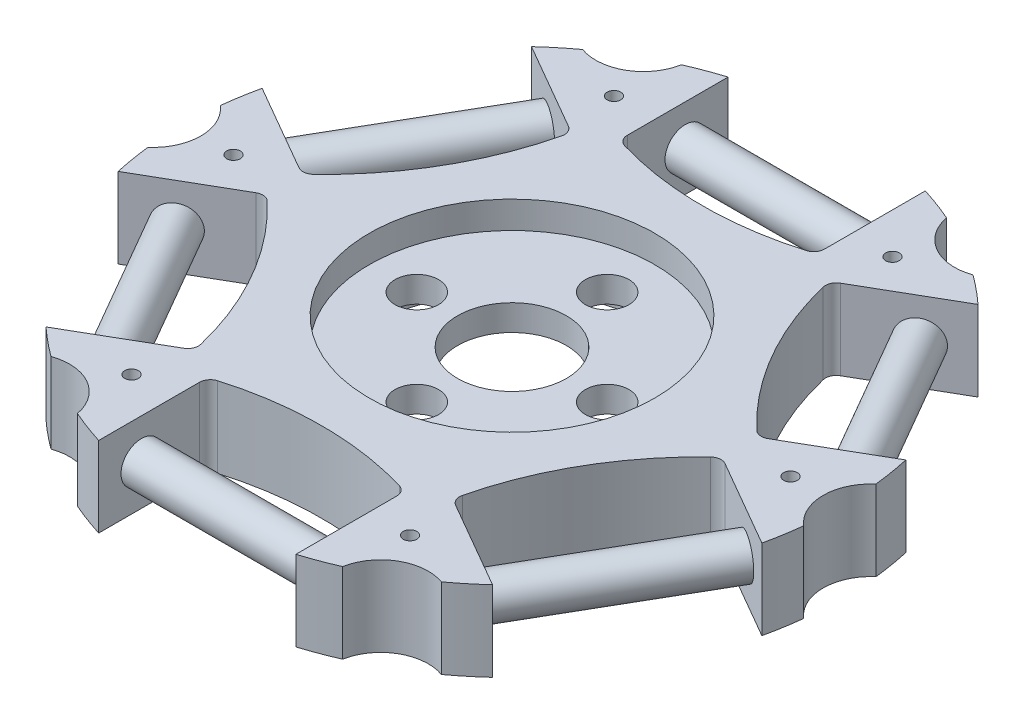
ISO-10303-21;
HEADER;
FILE_DESCRIPTION(('STEP AP214'),'2;1');
FILE_NAME('part.step','',(''),(''),'','','');
FILE_SCHEMA(('AUTOMOTIVE_DESIGN { 1 0 10303 214 1 1 1 1 }'));
ENDSEC;
DATA;
#1=APPLICATION_CONTEXT('core data for automotive mechanical design processes');
#2=APPLICATION_PROTOCOL_DEFINITION('international standard','automotive_design',2000,#1);
#3=PRODUCT_CONTEXT('',#1,'mechanical');
#4=PRODUCT('Part','Part','',(#3));
#5=PRODUCT_RELATED_PRODUCT_CATEGORY('part','',(#4));
#6=PRODUCT_DEFINITION_FORMATION('','',#4);
#7=PRODUCT_DEFINITION_CONTEXT('part definition',#1,'design');
#8=PRODUCT_DEFINITION('design','',#6,#7);
#9=PRODUCT_DEFINITION_SHAPE('','',#8);
#10=(LENGTH_UNIT() NAMED_UNIT(*) SI_UNIT(.MILLI.,.METRE.));
#11=(NAMED_UNIT(*) PLANE_ANGLE_UNIT() SI_UNIT($,.RADIAN.));
#12=(NAMED_UNIT(*) SI_UNIT($,.STERADIAN.) SOLID_ANGLE_UNIT());
#13=UNCERTAINTY_MEASURE_WITH_UNIT(LENGTH_MEASURE(1.E-05),#10,'distance_accuracy_value','');
#14=(GEOMETRIC_REPRESENTATION_CONTEXT(3) GLOBAL_UNCERTAINTY_ASSIGNED_CONTEXT((#13)) GLOBAL_UNIT_ASSIGNED_CONTEXT((#10,
#11,#12)) REPRESENTATION_CONTEXT('',''));
#15=CARTESIAN_POINT('',(0.,0.,0.));
#16=DIRECTION('',(0.,0.,1.));
#17=DIRECTION('',(1.,0.,0.));
#18=AXIS2_PLACEMENT_3D('',#15,#16,#17);
#19=CARTESIAN_POINT('',(0.,-3.,0.));
#20=DIRECTION('',(0.,1.,0.));
#21=DIRECTION('',(0.,0.,1.));
#22=AXIS2_PLACEMENT_3D('',#19,#20,#21);
#23=CYLINDRICAL_SURFACE('',#22,24.25);
#24=DIRECTION('',(0.,1.,0.));
#25=VECTOR('',#24,1.);
#26=CARTESIAN_POINT('',(14.3544485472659,-3.,19.545135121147));
#27=LINE('',#26,#25);
#28=CARTESIAN_POINT('',(14.3544485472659,-3.,19.545135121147));
#29=VERTEX_POINT('',#28);
#30=CARTESIAN_POINT('',(14.3544485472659,2.9,19.545135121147));
#31=VERTEX_POINT('',#30);
#32=EDGE_CURVE('E350',#29,#31,#27,.T.);
#33=ORIENTED_EDGE('',*,*,#32,.F.);
#34=CARTESIAN_POINT('',(0.,-3.,0.));
#35=DIRECTION('',(0.,1.,0.));
#36=DIRECTION('',(0.,0.,1.));
#37=AXIS2_PLACEMENT_3D('',#34,#35,#36);
#38=CIRCLE('',#37,24.25);
#39=CARTESIAN_POINT('',(16.4155838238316,-3.,17.8491206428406));
#40=VERTEX_POINT('',#39);
#41=EDGE_CURVE('E359',#29,#40,#38,.T.);
#42=ORIENTED_EDGE('',*,*,#41,.T.);
#43=DIRECTION('',(0.,1.,0.));
#44=VECTOR('',#43,1.);
#45=CARTESIAN_POINT('',(16.4155838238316,-3.,17.8491206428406));
#46=LINE('',#45,#44);
#47=CARTESIAN_POINT('',(16.4155838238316,2.9,17.8491206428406));
#48=VERTEX_POINT('',#47);
#49=EDGE_CURVE('E546',#40,#48,#46,.T.);
#50=ORIENTED_EDGE('',*,*,#49,.T.);
#51=CARTESIAN_POINT('',(0.,2.9,0.));
#52=DIRECTION('',(0.,1.,0.));
#53=DIRECTION('',(0.,0.,1.));
#54=AXIS2_PLACEMENT_3D('',#51,#52,#53);
#55=CIRCLE('',#54,24.25);
#56=EDGE_CURVE('E381',#31,#48,#55,.T.);
#57=ORIENTED_EDGE('',*,*,#56,.F.);
#58=EDGE_LOOP('',(#33,#42,#50,#57));
#59=FACE_BOUND('',#58,.T.);
#60=ADVANCED_FACE('F34',(#59),#23,.T.);
#61=DIRECTION('',(0.,1.,0.));
#62=VECTOR('',#61,1.);
#63=CARTESIAN_POINT('',(9.74935926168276,-3.,22.2038846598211));
#64=LINE('',#63,#62);
#65=CARTESIAN_POINT('',(9.74935926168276,-3.,22.2038846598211));
#66=VERTEX_POINT('',#65);
#67=CARTESIAN_POINT('',(9.74935926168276,2.9,22.2038846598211));
#68=VERTEX_POINT('',#67);
#69=EDGE_CURVE('E339',#66,#68,#64,.T.);
#70=ORIENTED_EDGE('',*,*,#69,.T.);
#71=CARTESIAN_POINT('',(7.25000000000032,2.9,23.1408729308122));
#72=VERTEX_POINT('',#71);
#73=EDGE_CURVE('E374',#72,#68,#55,.T.);
#74=ORIENTED_EDGE('',*,*,#73,.F.);
#75=DIRECTION('',(0.,1.,0.));
#76=VECTOR('',#75,1.);
#77=CARTESIAN_POINT('',(7.25000000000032,-3.,23.1408729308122));
#78=LINE('',#77,#76);
#79=CARTESIAN_POINT('',(7.25000000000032,-3.,23.1408729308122));
#80=VERTEX_POINT('',#79);
#81=EDGE_CURVE('E363',#80,#72,#78,.T.);
#82=ORIENTED_EDGE('',*,*,#81,.F.);
#83=EDGE_CURVE('E357',#80,#66,#38,.T.);
#84=ORIENTED_EDGE('',*,*,#83,.T.);
#85=EDGE_LOOP('',(#70,#74,#82,#84));
#86=FACE_BOUND('',#85,.T.);
#87=ADVANCED_FACE('F362',(#86),#23,.T.);
#88=DIRECTION('',(0.,1.,0.));
#89=VECTOR('',#88,1.);
#90=CARTESIAN_POINT('',(24.1038078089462,-3.,-2.65874953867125));
#91=LINE('',#90,#89);
#92=CARTESIAN_POINT('',(24.1038078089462,-3.,-2.65874953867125));
#93=VERTEX_POINT('',#92);
#94=CARTESIAN_POINT('',(24.1038078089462,2.9,-2.65874953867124));
#95=VERTEX_POINT('',#94);
#96=EDGE_CURVE('E531',#93,#95,#91,.T.);
#97=ORIENTED_EDGE('',*,*,#96,.F.);
#98=CARTESIAN_POINT('',(23.6655838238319,-3.,-5.29175228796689));
#99=VERTEX_POINT('',#98);
#100=EDGE_CURVE('E1113',#93,#99,#38,.T.);
#101=ORIENTED_EDGE('',*,*,#100,.T.);
#102=DIRECTION('',(0.,1.,0.));
#103=VECTOR('',#102,1.);
#104=CARTESIAN_POINT('',(23.6655838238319,-3.,-5.29175228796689));
#105=LINE('',#104,#103);
#106=CARTESIAN_POINT('',(23.6655838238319,2.9,-5.29175228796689));
#107=VERTEX_POINT('',#106);
#108=EDGE_CURVE('E514',#99,#107,#105,.T.);
#109=ORIENTED_EDGE('',*,*,#108,.T.);
#110=EDGE_CURVE('E1153',#95,#107,#55,.T.);
#111=ORIENTED_EDGE('',*,*,#110,.F.);
#112=EDGE_LOOP('',(#97,#101,#109,#111));
#113=FACE_BOUND('',#112,.T.);
#114=ADVANCED_FACE('F686',(#113),#23,.T.);
#115=DIRECTION('',(0.,1.,0.));
#116=VECTOR('',#115,1.);
#117=CARTESIAN_POINT('',(23.665583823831,-3.,5.29175228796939));
#118=LINE('',#117,#116);
#119=CARTESIAN_POINT('',(23.665583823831,-3.,5.29175228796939));
#120=VERTEX_POINT('',#119);
#121=CARTESIAN_POINT('',(23.665583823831,2.9,5.29175228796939));
#122=VERTEX_POINT('',#121);
#123=EDGE_CURVE('E549',#120,#122,#118,.T.);
#124=ORIENTED_EDGE('',*,*,#123,.F.);
#125=CARTESIAN_POINT('',(24.1038078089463,-3.,2.65874953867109));
#126=VERTEX_POINT('',#125);
#127=EDGE_CURVE('E369',#120,#126,#38,.T.);
#128=ORIENTED_EDGE('',*,*,#127,.T.);
#129=DIRECTION('',(0.,1.,0.));
#130=VECTOR('',#129,1.);
#131=CARTESIAN_POINT('',(24.1038078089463,-3.,2.65874953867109));
#132=LINE('',#131,#130);
#133=CARTESIAN_POINT('',(24.1038078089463,2.9,2.65874953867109));
#134=VERTEX_POINT('',#133);
#135=EDGE_CURVE('E538',#126,#134,#132,.T.);
#136=ORIENTED_EDGE('',*,*,#135,.T.);
#137=EDGE_CURVE('E385',#122,#134,#55,.T.);
#138=ORIENTED_EDGE('',*,*,#137,.F.);
#139=EDGE_LOOP('',(#124,#128,#136,#138));
#140=FACE_BOUND('',#139,.T.);
#141=ADVANCED_FACE('F1127',(#140),#23,.T.);
#142=DIRECTION('',(0.,1.,0.));
#143=VECTOR('',#142,1.);
#144=CARTESIAN_POINT('',(9.74935926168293,-3.,-22.2038846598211));
#145=LINE('',#144,#143);
#146=CARTESIAN_POINT('',(9.74935926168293,-3.,-22.2038846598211));
#147=VERTEX_POINT('',#146);
#148=CARTESIAN_POINT('',(9.74935926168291,2.9,-22.2038846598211));
#149=VERTEX_POINT('',#148);
#150=EDGE_CURVE('E500',#147,#149,#145,.T.);
#151=ORIENTED_EDGE('',*,*,#150,.F.);
#152=CARTESIAN_POINT('',(7.25,-3.,-23.1408729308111));
#153=VERTEX_POINT('',#152);
#154=EDGE_CURVE('E1109',#147,#153,#38,.T.);
#155=ORIENTED_EDGE('',*,*,#154,.T.);
#156=DIRECTION('',(0.,1.,0.));
#157=VECTOR('',#156,1.);
#158=CARTESIAN_POINT('',(7.25,-3.,-23.1408729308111));
#159=LINE('',#158,#157);
#160=CARTESIAN_POINT('',(7.25,2.9,-23.1408729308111));
#161=VERTEX_POINT('',#160);
#162=EDGE_CURVE('E484',#153,#161,#159,.T.);
#163=ORIENTED_EDGE('',*,*,#162,.T.);
#164=EDGE_CURVE('E1071',#149,#161,#55,.T.);
#165=ORIENTED_EDGE('',*,*,#164,.F.);
#166=EDGE_LOOP('',(#151,#155,#163,#165));
#167=FACE_BOUND('',#166,.T.);
#168=ADVANCED_FACE('F1152',(#167),#23,.T.);
#169=DIRECTION('',(0.,1.,0.));
#170=VECTOR('',#169,1.);
#171=CARTESIAN_POINT('',(16.4155838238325,-3.,-17.849120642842));
#172=LINE('',#171,#170);
#173=CARTESIAN_POINT('',(16.4155838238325,-3.,-17.849120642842));
#174=VERTEX_POINT('',#173);
#175=CARTESIAN_POINT('',(16.4155838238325,2.9,-17.849120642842));
#176=VERTEX_POINT('',#175);
#177=EDGE_CURVE('E517',#174,#176,#172,.T.);
#178=ORIENTED_EDGE('',*,*,#177,.F.);
#179=CARTESIAN_POINT('',(14.3544485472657,-3.,-19.5451351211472));
#180=VERTEX_POINT('',#179);
#181=EDGE_CURVE('E1110',#174,#180,#38,.T.);
#182=ORIENTED_EDGE('',*,*,#181,.T.);
#183=DIRECTION('',(0.,1.,0.));
#184=VECTOR('',#183,1.);
#185=CARTESIAN_POINT('',(14.3544485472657,-3.,-19.5451351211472));
#186=LINE('',#185,#184);
#187=CARTESIAN_POINT('',(14.3544485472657,2.9,-19.5451351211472));
#188=VERTEX_POINT('',#187);
#189=EDGE_CURVE('E506',#180,#188,#186,.T.);
#190=ORIENTED_EDGE('',*,*,#189,.T.);
#191=EDGE_CURVE('E1073',#176,#188,#55,.T.);
#192=ORIENTED_EDGE('',*,*,#191,.F.);
#193=EDGE_LOOP('',(#178,#182,#190,#192));
#194=FACE_BOUND('',#193,.T.);
#195=ADVANCED_FACE('F1149',(#194),#23,.T.);
#196=DIRECTION('',(0.,1.,0.));
#197=VECTOR('',#196,1.);
#198=CARTESIAN_POINT('',(-14.3544485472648,-3.,-19.5451351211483));
#199=LINE('',#198,#197);
#200=CARTESIAN_POINT('',(-14.3544485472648,-3.,-19.5451351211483));
#201=VERTEX_POINT('',#200);
#202=CARTESIAN_POINT('',(-14.3544485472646,2.9,-19.545135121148));
#203=VERTEX_POINT('',#202);
#204=EDGE_CURVE('E469',#201,#203,#199,.T.);
#205=ORIENTED_EDGE('',*,*,#204,.F.);
#206=CARTESIAN_POINT('',(-16.4155838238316,-3.,-17.8491206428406));
#207=VERTEX_POINT('',#206);
#208=EDGE_CURVE('E1100',#201,#207,#38,.T.);
#209=ORIENTED_EDGE('',*,*,#208,.T.);
#210=DIRECTION('',(0.,1.,0.));
#211=VECTOR('',#210,1.);
#212=CARTESIAN_POINT('',(-16.4155838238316,-3.,-17.8491206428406));
#213=LINE('',#212,#211);
#214=CARTESIAN_POINT('',(-16.4155838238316,2.9,-17.8491206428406));
#215=VERTEX_POINT('',#214);
#216=EDGE_CURVE('E452',#207,#215,#213,.T.);
#217=ORIENTED_EDGE('',*,*,#216,.T.);
#218=EDGE_CURVE('E1072',#203,#215,#55,.T.);
#219=ORIENTED_EDGE('',*,*,#218,.F.);
#220=EDGE_LOOP('',(#205,#209,#217,#219));
#221=FACE_BOUND('',#220,.T.);
#222=ADVANCED_FACE('F1213',(#221),#23,.T.);
#223=DIRECTION('',(0.,1.,0.));
#224=VECTOR('',#223,1.);
#225=CARTESIAN_POINT('',(-7.25000000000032,-3.,-23.1408729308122));
#226=LINE('',#225,#224);
#227=CARTESIAN_POINT('',(-7.25000000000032,-3.,-23.1408729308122));
#228=VERTEX_POINT('',#227);
#229=CARTESIAN_POINT('',(-7.25000000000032,2.9,-23.1408729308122));
#230=VERTEX_POINT('',#229);
#231=EDGE_CURVE('E487',#228,#230,#226,.T.);
#232=ORIENTED_EDGE('',*,*,#231,.F.);
#233=CARTESIAN_POINT('',(-9.74935926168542,-3.,-22.2038846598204));
#234=VERTEX_POINT('',#233);
#235=EDGE_CURVE('E1063',#228,#234,#38,.T.);
#236=ORIENTED_EDGE('',*,*,#235,.T.);
#237=DIRECTION('',(0.,1.,0.));
#238=VECTOR('',#237,1.);
#239=CARTESIAN_POINT('',(-9.74935926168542,-3.,-22.2038846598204));
#240=LINE('',#239,#238);
#241=CARTESIAN_POINT('',(-9.74935926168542,2.9,-22.2038846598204));
#242=VERTEX_POINT('',#241);
#243=EDGE_CURVE('E476',#234,#242,#240,.T.);
#244=ORIENTED_EDGE('',*,*,#243,.T.);
#245=EDGE_CURVE('E1069',#230,#242,#55,.T.);
#246=ORIENTED_EDGE('',*,*,#245,.F.);
#247=EDGE_LOOP('',(#232,#236,#244,#246));
#248=FACE_BOUND('',#247,.T.);
#249=ADVANCED_FACE('F1067',(#248),#23,.T.);
#250=DIRECTION('',(0.,1.,0.));
#251=VECTOR('',#250,1.);
#252=CARTESIAN_POINT('',(-24.1038078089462,-3.,2.65874953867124));
#253=LINE('',#252,#251);
#254=CARTESIAN_POINT('',(-24.1038078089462,-3.,2.65874953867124));
#255=VERTEX_POINT('',#254);
#256=CARTESIAN_POINT('',(-24.1038078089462,2.9,2.65874953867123));
#257=VERTEX_POINT('',#256);
#258=EDGE_CURVE('E437',#255,#257,#253,.T.);
#259=ORIENTED_EDGE('',*,*,#258,.F.);
#260=CARTESIAN_POINT('',(-23.6655838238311,-3.,5.29175228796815));
#261=VERTEX_POINT('',#260);
#262=EDGE_CURVE('E380',#255,#261,#38,.T.);
#263=ORIENTED_EDGE('',*,*,#262,.T.);
#264=DIRECTION('',(0.,1.,0.));
#265=VECTOR('',#264,1.);
#266=CARTESIAN_POINT('',(-23.6655838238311,-3.,5.29175228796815));
#267=LINE('',#266,#265);
#268=CARTESIAN_POINT('',(-23.6655838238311,2.9,5.29175228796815));
#269=VERTEX_POINT('',#268);
#270=EDGE_CURVE('E420',#261,#269,#267,.T.);
#271=ORIENTED_EDGE('',*,*,#270,.T.);
#272=EDGE_CURVE('E393',#257,#269,#55,.T.);
#273=ORIENTED_EDGE('',*,*,#272,.F.);
#274=EDGE_LOOP('',(#259,#263,#271,#273));
#275=FACE_BOUND('',#274,.T.);
#276=ADVANCED_FACE('F1088',(#275),#23,.T.);
#277=DIRECTION('',(0.,1.,0.));
#278=VECTOR('',#277,1.);
#279=CARTESIAN_POINT('',(-23.6655838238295,-3.,-5.2917522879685));
#280=LINE('',#279,#278);
#281=CARTESIAN_POINT('',(-23.6655838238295,-3.,-5.2917522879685));
#282=VERTEX_POINT('',#281);
#283=CARTESIAN_POINT('',(-23.665583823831,2.9,-5.29175228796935));
#284=VERTEX_POINT('',#283);
#285=EDGE_CURVE('E455',#282,#284,#280,.T.);
#286=ORIENTED_EDGE('',*,*,#285,.F.);
#287=CARTESIAN_POINT('',(-24.1038078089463,-3.,-2.65874953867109));
#288=VERTEX_POINT('',#287);
#289=EDGE_CURVE('E1099',#282,#288,#38,.T.);
#290=ORIENTED_EDGE('',*,*,#289,.T.);
#291=DIRECTION('',(0.,1.,0.));
#292=VECTOR('',#291,1.);
#293=CARTESIAN_POINT('',(-24.1038078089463,-3.,-2.65874953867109));
#294=LINE('',#293,#292);
#295=CARTESIAN_POINT('',(-24.1038078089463,2.9,-2.65874953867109));
#296=VERTEX_POINT('',#295);
#297=EDGE_CURVE('E444',#288,#296,#294,.T.);
#298=ORIENTED_EDGE('',*,*,#297,.T.);
#299=EDGE_CURVE('E1075',#284,#296,#55,.T.);
#300=ORIENTED_EDGE('',*,*,#299,.F.);
#301=EDGE_LOOP('',(#286,#290,#298,#300));
#302=FACE_BOUND('',#301,.T.);
#303=ADVANCED_FACE('F698',(#302),#23,.T.);
#304=DIRECTION('',(0.,1.,0.));
#305=VECTOR('',#304,1.);
#306=CARTESIAN_POINT('',(-9.74935926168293,-3.,22.2038846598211));
#307=LINE('',#306,#305);
#308=CARTESIAN_POINT('',(-9.74935926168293,-3.,22.2038846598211));
#309=VERTEX_POINT('',#308);
#310=CARTESIAN_POINT('',(-9.74935926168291,2.9,22.2038846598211));
#311=VERTEX_POINT('',#310);
#312=EDGE_CURVE('E406',#309,#311,#307,.T.);
#313=ORIENTED_EDGE('',*,*,#312,.F.);
#314=CARTESIAN_POINT('',(-7.25000000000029,-3.,23.1408729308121));
#315=VERTEX_POINT('',#314);
#316=EDGE_CURVE('E366',#309,#315,#38,.T.);
#317=ORIENTED_EDGE('',*,*,#316,.T.);
#318=DIRECTION('',(0.,1.,0.));
#319=VECTOR('',#318,1.);
#320=CARTESIAN_POINT('',(-7.25000000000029,-3.,23.1408729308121));
#321=LINE('',#320,#319);
#322=CARTESIAN_POINT('',(-7.25000000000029,2.9,23.1408729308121));
#323=VERTEX_POINT('',#322);
#324=EDGE_CURVE('E389',#315,#323,#321,.T.);
#325=ORIENTED_EDGE('',*,*,#324,.T.);
#326=EDGE_CURVE('E382',#311,#323,#55,.T.);
#327=ORIENTED_EDGE('',*,*,#326,.F.);
#328=EDGE_LOOP('',(#313,#317,#325,#327));
#329=FACE_BOUND('',#328,.T.);
#330=ADVANCED_FACE('F690',(#329),#23,.T.);
#331=DIRECTION('',(0.,1.,0.));
#332=VECTOR('',#331,1.);
#333=CARTESIAN_POINT('',(-16.4155838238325,-3.,17.849120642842));
#334=LINE('',#333,#332);
#335=CARTESIAN_POINT('',(-16.4155838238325,-3.,17.849120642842));
#336=VERTEX_POINT('',#335);
#337=CARTESIAN_POINT('',(-16.4155838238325,2.9,17.849120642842));
#338=VERTEX_POINT('',#337);
#339=EDGE_CURVE('E423',#336,#338,#334,.T.);
#340=ORIENTED_EDGE('',*,*,#339,.F.);
#341=CARTESIAN_POINT('',(-14.3544485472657,-3.,19.5451351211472));
#342=VERTEX_POINT('',#341);
#343=EDGE_CURVE('E373',#336,#342,#38,.T.);
#344=ORIENTED_EDGE('',*,*,#343,.T.);
#345=DIRECTION('',(0.,1.,0.));
#346=VECTOR('',#345,1.);
#347=CARTESIAN_POINT('',(-14.3544485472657,-3.,19.5451351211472));
#348=LINE('',#347,#346);
#349=CARTESIAN_POINT('',(-14.3544485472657,2.9,19.5451351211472));
#350=VERTEX_POINT('',#349);
#351=EDGE_CURVE('E412',#342,#350,#348,.T.);
#352=ORIENTED_EDGE('',*,*,#351,.T.);
#353=EDGE_CURVE('E388',#338,#350,#55,.T.);
#354=ORIENTED_EDGE('',*,*,#353,.F.);
#355=EDGE_LOOP('',(#340,#344,#352,#354));
#356=FACE_BOUND('',#355,.T.);
#357=ADVANCED_FACE('F682',(#356),#23,.T.);
#358=CARTESIAN_POINT('',(24.25,-3.,0.));
#359=DIRECTION('',(0.,-1.,0.));
#360=DIRECTION('',(0.,0.,-1.));
#361=AXIS2_PLACEMENT_3D('',#358,#359,#360);
#362=PLANE('',#361);
#363=CARTESIAN_POINT('',(10.2400000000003,-3.,-17.7362002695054));
#364=DIRECTION('',(0.,-1.,0.));
#365=DIRECTION('',(-0.866025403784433,0.,-0.50000000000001));
#366=AXIS2_PLACEMENT_3D('',#363,#364,#365);
#367=CIRCLE('',#366,0.499999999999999);
#368=CARTESIAN_POINT('',(9.80698729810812,-3.,-17.9862002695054));
#369=VERTEX_POINT('',#368);
#370=EDGE_CURVE('E631',#369,#369,#367,.T.);
#371=ORIENTED_EDGE('',*,*,#370,.F.);
#372=EDGE_LOOP('',(#371));
#373=FACE_BOUND('',#372,.T.);
#374=CARTESIAN_POINT('',(-10.24,-3.,-17.7362002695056));
#375=DIRECTION('',(0.,-1.,0.));
#376=DIRECTION('',(-0.866025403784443,0.,0.499999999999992));
#377=AXIS2_PLACEMENT_3D('',#374,#375,#376);
#378=CIRCLE('',#377,0.499999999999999);
#379=CARTESIAN_POINT('',(-10.6730127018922,-3.,-17.4862002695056));
#380=VERTEX_POINT('',#379);
#381=EDGE_CURVE('E628',#380,#380,#378,.T.);
#382=ORIENTED_EDGE('',*,*,#381,.F.);
#383=EDGE_LOOP('',(#382));
#384=FACE_BOUND('',#383,.T.);
#385=CARTESIAN_POINT('',(-20.4800000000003,-3.00000000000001,0.));
#386=DIRECTION('',(0.,-1.,0.));
#387=DIRECTION('',(0.,0.,1.));
#388=AXIS2_PLACEMENT_3D('',#385,#386,#387);
#389=CIRCLE('',#388,0.499999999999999);
#390=CARTESIAN_POINT('',(-20.4800000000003,-3.00000000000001,0.499999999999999));
#391=VERTEX_POINT('',#390);
#392=EDGE_CURVE('E624',#391,#391,#389,.T.);
#393=ORIENTED_EDGE('',*,*,#392,.F.);
#394=EDGE_LOOP('',(#393));
#395=FACE_BOUND('',#394,.T.);
#396=CARTESIAN_POINT('',(-10.2400000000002,-3.,17.7362002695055));
#397=DIRECTION('',(0.,-1.,0.));
#398=DIRECTION('',(0.866025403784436,0.,0.500000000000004));
#399=AXIS2_PLACEMENT_3D('',#396,#397,#398);
#400=CIRCLE('',#399,0.499999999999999);
#401=CARTESIAN_POINT('',(-9.80698729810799,-3.,17.9862002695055));
#402=VERTEX_POINT('',#401);
#403=EDGE_CURVE('E620',#402,#402,#400,.T.);
#404=ORIENTED_EDGE('',*,*,#403,.F.);
#405=EDGE_LOOP('',(#404));
#406=FACE_BOUND('',#405,.T.);
#407=CARTESIAN_POINT('',(10.2400000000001,-3.,17.7362002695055));
#408=DIRECTION('',(0.,-1.,0.));
#409=DIRECTION('',(0.86602540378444,0.,-0.499999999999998));
#410=AXIS2_PLACEMENT_3D('',#407,#408,#409);
#411=CIRCLE('',#410,0.499999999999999);
#412=CARTESIAN_POINT('',(10.6730127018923,-3.,17.4862002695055));
#413=VERTEX_POINT('',#412);
#414=EDGE_CURVE('E616',#413,#413,#411,.T.);
#415=ORIENTED_EDGE('',*,*,#414,.F.);
#416=EDGE_LOOP('',(#415));
#417=FACE_BOUND('',#416,.T.);
#418=CARTESIAN_POINT('',(20.4800000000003,-3.,0.));
#419=DIRECTION('',(0.,-1.,0.));
#420=DIRECTION('',(0.,0.,-1.));
#421=AXIS2_PLACEMENT_3D('',#418,#419,#420);
#422=CIRCLE('',#421,0.499999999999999);
#423=CARTESIAN_POINT('',(20.4800000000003,-3.,-0.499999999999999));
#424=VERTEX_POINT('',#423);
#425=EDGE_CURVE('E612',#424,#424,#422,.T.);
#426=ORIENTED_EDGE('',*,*,#425,.F.);
#427=EDGE_LOOP('',(#426));
#428=FACE_BOUND('',#427,.T.);
#429=CARTESIAN_POINT('',(0.,-3.,0.));
#430=DIRECTION('',(0.,-1.,0.));
#431=DIRECTION('',(1.,0.,0.));
#432=AXIS2_PLACEMENT_3D('',#429,#430,#431);
#433=CIRCLE('',#432,10.5);
#434=CARTESIAN_POINT('',(10.5,-3.,0.));
#435=VERTEX_POINT('',#434);
#436=EDGE_CURVE('E574',#435,#435,#433,.T.);
#437=ORIENTED_EDGE('',*,*,#436,.F.);
#438=EDGE_LOOP('',(#437));
#439=FACE_BOUND('',#438,.T.);
#440=CARTESIAN_POINT('',(13.19,-3.,22.84575015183));
#441=DIRECTION('',(0.,1.,0.));
#442=DIRECTION('',(0.,0.,1.));
#443=AXIS2_PLACEMENT_3D('',#440,#441,#442);
#444=CIRCLE('',#443,3.5);
#445=EDGE_CURVE('E342',#29,#66,#444,.T.);
#446=ORIENTED_EDGE('',*,*,#445,.T.);
#447=ORIENTED_EDGE('',*,*,#83,.F.);
#448=DIRECTION('',(0.,0.,-1.));
#449=VECTOR('',#448,1.);
#450=CARTESIAN_POINT('',(7.25000000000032,-3.,23.1408729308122));
#451=LINE('',#450,#449);
#452=CARTESIAN_POINT('',(7.25000000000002,-3.,15.7310802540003));
#453=VERTEX_POINT('',#452);
#454=EDGE_CURVE('E399',#80,#453,#451,.T.);
#455=ORIENTED_EDGE('',*,*,#454,.T.);
#456=CARTESIAN_POINT('',(6.45000000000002,-3.,15.7310802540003));
#457=DIRECTION('',(0.,-1.,0.));
#458=DIRECTION('',(0.,0.,-1.));
#459=AXIS2_PLACEMENT_3D('',#456,#457,#458);
#460=CIRCLE('',#459,0.8);
#461=CARTESIAN_POINT('',(6.67625103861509,-3.,14.963740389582));
#462=VERTEX_POINT('',#461);
#463=EDGE_CURVE('E768',#453,#462,#460,.F.);
#464=ORIENTED_EDGE('',*,*,#463,.T.);
#465=CARTESIAN_POINT('',(1.47104652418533E-12,-3.,37.6065251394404));
#466=DIRECTION('',(0.,1.,0.));
#467=DIRECTION('',(0.,0.,1.));
#468=AXIS2_PLACEMENT_3D('',#465,#466,#467);
#469=CIRCLE('',#468,23.6065251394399);
#470=CARTESIAN_POINT('',(-6.67625103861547,-3.,14.9637403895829));
#471=VERTEX_POINT('',#470);
#472=EDGE_CURVE('E408',#462,#471,#469,.T.);
#473=ORIENTED_EDGE('',*,*,#472,.T.);
#474=CARTESIAN_POINT('',(-6.45000000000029,-3.,15.7310802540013));
#475=DIRECTION('',(0.,-1.,0.));
#476=DIRECTION('',(0.,0.,-1.));
#477=AXIS2_PLACEMENT_3D('',#474,#475,#476);
#478=CIRCLE('',#477,0.8);
#479=CARTESIAN_POINT('',(-7.25000000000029,-3.,15.7310802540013));
#480=VERTEX_POINT('',#479);
#481=EDGE_CURVE('E794',#471,#480,#478,.F.);
#482=ORIENTED_EDGE('',*,*,#481,.T.);
#483=DIRECTION('',(0.,0.,1.));
#484=VECTOR('',#483,1.);
#485=CARTESIAN_POINT('',(-7.25000000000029,-3.,15.1408729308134));
#486=LINE('',#485,#484);
#487=EDGE_CURVE('E395',#480,#315,#486,.T.);
#488=ORIENTED_EDGE('',*,*,#487,.T.);
#489=ORIENTED_EDGE('',*,*,#316,.F.);
#490=CARTESIAN_POINT('',(-13.19,-3.,22.84575015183));
#491=DIRECTION('',(0.,1.,0.));
#492=DIRECTION('',(0.,0.,1.));
#493=AXIS2_PLACEMENT_3D('',#490,#491,#492);
#494=CIRCLE('',#493,3.49999999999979);
#495=EDGE_CURVE('E415',#309,#342,#494,.T.);
#496=ORIENTED_EDGE('',*,*,#495,.T.);
#497=ORIENTED_EDGE('',*,*,#343,.F.);
#498=DIRECTION('',(0.8660254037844,0.,-0.500000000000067));
#499=VECTOR('',#498,1.);
#500=CARTESIAN_POINT('',(-16.4155838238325,-3.,17.849120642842));
#501=LINE('',#500,#499);
#502=CARTESIAN_POINT('',(-9.99851512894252,-3.,14.1442243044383));
#503=VERTEX_POINT('',#502);
#504=EDGE_CURVE('E430',#336,#503,#501,.T.);
#505=ORIENTED_EDGE('',*,*,#504,.T.);
#506=CARTESIAN_POINT('',(-10.3985151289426,-3.,13.4514039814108));
#507=DIRECTION('',(0.,-1.,0.));
#508=DIRECTION('',(0.,0.,-1.));
#509=AXIS2_PLACEMENT_3D('',#506,#507,#508);
#510=CIRCLE('',#509,0.8);
#511=CARTESIAN_POINT('',(-9.62085379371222,-3.,13.2636731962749));
#512=VERTEX_POINT('',#511);
#513=EDGE_CURVE('E717',#503,#512,#510,.F.);
#514=ORIENTED_EDGE('',*,*,#513,.T.);
#515=CARTESIAN_POINT('',(-32.5682061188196,-3.,18.8032625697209));
#516=DIRECTION('',(0.,1.,0.));
#517=DIRECTION('',(0.,0.,1.));
#518=AXIS2_PLACEMENT_3D('',#515,#516,#517);
#519=CIRCLE('',#518,23.6065251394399);
#520=CARTESIAN_POINT('',(-16.297104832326,-3.,1.70006719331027));
#521=VERTEX_POINT('',#520);
#522=EDGE_CURVE('E439',#512,#521,#519,.T.);
#523=ORIENTED_EDGE('',*,*,#522,.T.);
#524=CARTESIAN_POINT('',(-16.8485151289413,-3.,2.27967627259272));
#525=DIRECTION('',(0.,-1.,0.));
#526=DIRECTION('',(0.,0.,-1.));
#527=AXIS2_PLACEMENT_3D('',#524,#525,#526);
#528=CIRCLE('',#527,0.8);
#529=CARTESIAN_POINT('',(-17.2485151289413,-3.,1.58685594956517));
#530=VERTEX_POINT('',#529);
#531=EDGE_CURVE('E786',#521,#530,#528,.F.);
#532=ORIENTED_EDGE('',*,*,#531,.T.);
#533=DIRECTION('',(-0.866025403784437,0.,0.500000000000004));
#534=VECTOR('',#533,1.);
#535=CARTESIAN_POINT('',(-16.7373805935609,-3.,1.29175228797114));
#536=LINE('',#535,#534);
#537=EDGE_CURVE('E425',#530,#261,#536,.T.);
#538=ORIENTED_EDGE('',*,*,#537,.T.);
#539=ORIENTED_EDGE('',*,*,#262,.F.);
#540=CARTESIAN_POINT('',(-26.38,-3.,0.));
#541=DIRECTION('',(0.,1.,0.));
#542=DIRECTION('',(0.,0.,1.));
#543=AXIS2_PLACEMENT_3D('',#540,#541,#542);
#544=CIRCLE('',#543,3.49999999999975);
#545=EDGE_CURVE('E447',#255,#288,#544,.T.);
#546=ORIENTED_EDGE('',*,*,#545,.T.);
#547=ORIENTED_EDGE('',*,*,#289,.F.);
#548=DIRECTION('',(0.866025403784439,0.,0.5));
#549=VECTOR('',#548,1.);
#550=CARTESIAN_POINT('',(-23.6655838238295,-3.,-5.2917522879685));
#551=LINE('',#550,#549);
#552=CARTESIAN_POINT('',(-17.2485151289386,-3.,-1.58685594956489));
#553=VERTEX_POINT('',#552);
#554=EDGE_CURVE('E462',#282,#553,#551,.T.);
#555=ORIENTED_EDGE('',*,*,#554,.T.);
#556=CARTESIAN_POINT('',(-16.8485151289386,-3.,-2.27967627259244));
#557=DIRECTION('',(0.,-1.,0.));
#558=DIRECTION('',(0.,0.,-1.));
#559=AXIS2_PLACEMENT_3D('',#556,#557,#558);
#560=CIRCLE('',#559,0.8);
#561=CARTESIAN_POINT('',(-16.2971048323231,-3.,-1.70006719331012));
#562=VERTEX_POINT('',#561);
#563=EDGE_CURVE('E764',#553,#562,#560,.F.);
#564=ORIENTED_EDGE('',*,*,#563,.T.);
#565=CARTESIAN_POINT('',(-32.5682061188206,-3.,-18.8032625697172));
#566=DIRECTION('',(0.,1.,0.));
#567=DIRECTION('',(0.,0.,1.));
#568=AXIS2_PLACEMENT_3D('',#565,#566,#567);
#569=CIRCLE('',#568,23.60652513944);
#570=CARTESIAN_POINT('',(-9.62085379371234,-3.,-13.2636731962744));
#571=VERTEX_POINT('',#570);
#572=EDGE_CURVE('E471',#562,#571,#569,.T.);
#573=ORIENTED_EDGE('',*,*,#572,.T.);
#574=CARTESIAN_POINT('',(-10.3985151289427,-3.,-13.4514039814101));
#575=DIRECTION('',(0.,-1.,0.));
#576=DIRECTION('',(0.,0.,-1.));
#577=AXIS2_PLACEMENT_3D('',#574,#575,#576);
#578=CIRCLE('',#577,0.8);
#579=CARTESIAN_POINT('',(-9.99851512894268,-3.,-14.1442243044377));
#580=VERTEX_POINT('',#579);
#581=EDGE_CURVE('E778',#571,#580,#578,.F.);
#582=ORIENTED_EDGE('',*,*,#581,.T.);
#583=DIRECTION('',(-0.86602540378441,0.,-0.500000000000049));
#584=VECTOR('',#583,1.);
#585=CARTESIAN_POINT('',(-9.48738059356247,-3.,-13.8491206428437));
#586=LINE('',#585,#584);
#587=EDGE_CURVE('E457',#580,#207,#586,.T.);
#588=ORIENTED_EDGE('',*,*,#587,.T.);
#589=ORIENTED_EDGE('',*,*,#208,.F.);
#590=CARTESIAN_POINT('',(-13.1900000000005,-3.,-22.8457501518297));
#591=DIRECTION('',(0.,1.,0.));
#592=DIRECTION('',(0.,0.,1.));
#593=AXIS2_PLACEMENT_3D('',#590,#591,#592);
#594=CIRCLE('',#593,3.49999999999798);
#595=EDGE_CURVE('E479',#201,#234,#594,.T.);
#596=ORIENTED_EDGE('',*,*,#595,.T.);
#597=ORIENTED_EDGE('',*,*,#235,.F.);
#598=DIRECTION('',(0.,0.,1.));
#599=VECTOR('',#598,1.);
#600=CARTESIAN_POINT('',(-7.25000000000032,-3.,-23.1408729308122));
#601=LINE('',#600,#599);
#602=CARTESIAN_POINT('',(-7.25000000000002,-3.,-15.7310802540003));
#603=VERTEX_POINT('',#602);
#604=EDGE_CURVE('E494',#228,#603,#601,.T.);
#605=ORIENTED_EDGE('',*,*,#604,.T.);
#606=CARTESIAN_POINT('',(-6.45000000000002,-3.,-15.7310802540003));
#607=DIRECTION('',(0.,-1.,0.));
#608=DIRECTION('',(0.,0.,-1.));
#609=AXIS2_PLACEMENT_3D('',#606,#607,#608);
#610=CIRCLE('',#609,0.8);
#611=CARTESIAN_POINT('',(-6.67625103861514,-3.,-14.963740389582));
#612=VERTEX_POINT('',#611);
#613=EDGE_CURVE('E11',#603,#612,#610,.F.);
#614=ORIENTED_EDGE('',*,*,#613,.T.);
#615=CARTESIAN_POINT('',(0.,-3.,-37.60652513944));
#616=DIRECTION('',(0.,1.,0.));
#617=DIRECTION('',(0.,0.,1.));
#618=AXIS2_PLACEMENT_3D('',#615,#616,#617);
#619=CIRCLE('',#618,23.60652513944);
#620=CARTESIAN_POINT('',(6.67625103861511,-3.,-14.963740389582));
#621=VERTEX_POINT('',#620);
#622=EDGE_CURVE('E502',#612,#621,#619,.T.);
#623=ORIENTED_EDGE('',*,*,#622,.T.);
#624=CARTESIAN_POINT('',(6.45,-3.,-15.7310802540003));
#625=DIRECTION('',(0.,-1.,0.));
#626=DIRECTION('',(0.,0.,-1.));
#627=AXIS2_PLACEMENT_3D('',#624,#625,#626);
#628=CIRCLE('',#627,0.8);
#629=CARTESIAN_POINT('',(7.25,-3.,-15.7310802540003));
#630=VERTEX_POINT('',#629);
#631=EDGE_CURVE('E798',#621,#630,#628,.F.);
#632=ORIENTED_EDGE('',*,*,#631,.T.);
#633=DIRECTION('',(0.,0.,-1.));
#634=VECTOR('',#633,1.);
#635=CARTESIAN_POINT('',(7.25,-3.,-15.1408729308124));
#636=LINE('',#635,#634);
#637=EDGE_CURVE('E489',#630,#153,#636,.T.);
#638=ORIENTED_EDGE('',*,*,#637,.T.);
#639=ORIENTED_EDGE('',*,*,#154,.F.);
#640=CARTESIAN_POINT('',(13.19,-3.,-22.84575015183));
#641=DIRECTION('',(0.,1.,0.));
#642=DIRECTION('',(0.,0.,1.));
#643=AXIS2_PLACEMENT_3D('',#640,#641,#642);
#644=CIRCLE('',#643,3.49999999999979);
#645=EDGE_CURVE('E509',#147,#180,#644,.T.);
#646=ORIENTED_EDGE('',*,*,#645,.T.);
#647=ORIENTED_EDGE('',*,*,#181,.F.);
#648=DIRECTION('',(-0.8660254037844,0.,0.500000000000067));
#649=VECTOR('',#648,1.);
#650=CARTESIAN_POINT('',(16.4155838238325,-3.,-17.849120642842));
#651=LINE('',#650,#649);
#652=CARTESIAN_POINT('',(9.99851512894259,-3.,-14.1442243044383));
#653=VERTEX_POINT('',#652);
#654=EDGE_CURVE('E524',#174,#653,#651,.T.);
#655=ORIENTED_EDGE('',*,*,#654,.T.);
#656=CARTESIAN_POINT('',(10.3985151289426,-3.,-13.4514039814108));
#657=DIRECTION('',(0.,-1.,0.));
#658=DIRECTION('',(0.,0.,-1.));
#659=AXIS2_PLACEMENT_3D('',#656,#657,#658);
#660=CIRCLE('',#659,0.8);
#661=CARTESIAN_POINT('',(9.62085379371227,-3.,-13.2636731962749));
#662=VERTEX_POINT('',#661);
#663=EDGE_CURVE('E790',#653,#662,#660,.F.);
#664=ORIENTED_EDGE('',*,*,#663,.T.);
#665=CARTESIAN_POINT('',(32.56820611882,-3.,-18.80326256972));
#666=DIRECTION('',(0.,1.,0.));
#667=DIRECTION('',(0.,0.,1.));
#668=AXIS2_PLACEMENT_3D('',#665,#666,#667);
#669=CIRCLE('',#668,23.60652513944);
#670=CARTESIAN_POINT('',(16.2971048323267,-3.,-1.70006719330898));
#671=VERTEX_POINT('',#670);
#672=EDGE_CURVE('E533',#662,#671,#669,.T.);
#673=ORIENTED_EDGE('',*,*,#672,.T.);
#674=CARTESIAN_POINT('',(16.8485151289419,-3.,-2.27967627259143));
#675=DIRECTION('',(0.,-1.,0.));
#676=DIRECTION('',(0.,0.,-1.));
#677=AXIS2_PLACEMENT_3D('',#674,#675,#676);
#678=CIRCLE('',#677,0.8);
#679=CARTESIAN_POINT('',(17.2485151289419,-3.,-1.58685594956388));
#680=VERTEX_POINT('',#679);
#681=EDGE_CURVE('E782',#671,#680,#678,.F.);
#682=ORIENTED_EDGE('',*,*,#681,.T.);
#683=DIRECTION('',(0.866025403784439,0.,-0.5));
#684=VECTOR('',#683,1.);
#685=CARTESIAN_POINT('',(16.7373805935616,-3.,-1.29175228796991));
#686=LINE('',#685,#684);
#687=EDGE_CURVE('E519',#680,#99,#686,.T.);
#688=ORIENTED_EDGE('',*,*,#687,.T.);
#689=ORIENTED_EDGE('',*,*,#100,.F.);
#690=CARTESIAN_POINT('',(26.38,-3.,0.));
#691=DIRECTION('',(0.,1.,0.));
#692=DIRECTION('',(0.,0.,1.));
#693=AXIS2_PLACEMENT_3D('',#690,#691,#692);
#694=CIRCLE('',#693,3.49999999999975);
#695=EDGE_CURVE('E541',#93,#126,#694,.T.);
#696=ORIENTED_EDGE('',*,*,#695,.T.);
#697=ORIENTED_EDGE('',*,*,#127,.F.);
#698=DIRECTION('',(-0.866025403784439,0.,-0.5));
#699=VECTOR('',#698,1.);
#700=CARTESIAN_POINT('',(23.665583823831,-3.,5.29175228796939));
#701=LINE('',#700,#699);
#702=CARTESIAN_POINT('',(17.24851512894,-3.,1.58685594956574));
#703=VERTEX_POINT('',#702);
#704=EDGE_CURVE('E556',#120,#703,#701,.T.);
#705=ORIENTED_EDGE('',*,*,#704,.T.);
#706=CARTESIAN_POINT('',(16.84851512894,-3.,2.27967627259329));
#707=DIRECTION('',(0.,-1.,0.));
#708=DIRECTION('',(0.,0.,-1.));
#709=AXIS2_PLACEMENT_3D('',#706,#707,#708);
#710=CIRCLE('',#709,0.8);
#711=CARTESIAN_POINT('',(16.2971048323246,-3.,1.70006719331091));
#712=VERTEX_POINT('',#711);
#713=EDGE_CURVE('E774',#703,#712,#710,.F.);
#714=ORIENTED_EDGE('',*,*,#713,.T.);
#715=CARTESIAN_POINT('',(32.56820611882,-3.,18.80326256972));
#716=DIRECTION('',(0.,1.,0.));
#717=DIRECTION('',(0.,0.,1.));
#718=AXIS2_PLACEMENT_3D('',#715,#716,#717);
#719=CIRCLE('',#718,23.60652513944);
#720=CARTESIAN_POINT('',(9.62085379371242,-3.,13.2636731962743));
#721=VERTEX_POINT('',#720);
#722=EDGE_CURVE('E564',#712,#721,#719,.T.);
#723=ORIENTED_EDGE('',*,*,#722,.T.);
#724=CARTESIAN_POINT('',(10.3985151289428,-3.,13.4514039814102));
#725=DIRECTION('',(0.,-1.,0.));
#726=DIRECTION('',(0.,0.,-1.));
#727=AXIS2_PLACEMENT_3D('',#724,#725,#726);
#728=CIRCLE('',#727,0.8);
#729=CARTESIAN_POINT('',(9.99851512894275,-3.,14.1442243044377));
#730=VERTEX_POINT('',#729);
#731=EDGE_CURVE('E802',#721,#730,#728,.F.);
#732=ORIENTED_EDGE('',*,*,#731,.T.);
#733=DIRECTION('',(0.86602540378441,0.,0.500000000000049));
#734=VECTOR('',#733,1.);
#735=CARTESIAN_POINT('',(9.48738059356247,-3.,13.8491206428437));
#736=LINE('',#735,#734);
#737=EDGE_CURVE('E551',#730,#40,#736,.T.);
#738=ORIENTED_EDGE('',*,*,#737,.T.);
#739=ORIENTED_EDGE('',*,*,#41,.F.);
#740=EDGE_LOOP('',(#446,#447,#455,#464,#473,#482,#488,#489,#496,#497,#505,#514,#523,#532,#538,
#539,#546,#547,#555,#564,#573,#582,#588,#589,#596,#597,#605,#614,#623,#632,#638,#639,#646,#647,
#655,#664,#673,#682,#688,#689,#696,#697,#705,#714,#723,#732,#738,#739));
#741=FACE_BOUND('',#740,.T.);
#742=ADVANCED_FACE('F355',(#373,#384,#395,#406,#417,#428,#439,#741),#362,.T.);
#743=CARTESIAN_POINT('',(0.,2.9,0.));
#744=DIRECTION('',(0.,1.,0.));
#745=DIRECTION('',(0.,0.,1.));
#746=AXIS2_PLACEMENT_3D('',#743,#744,#745);
#747=PLANE('',#746);
#748=CARTESIAN_POINT('',(10.2400000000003,2.9,-17.7362002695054));
#749=DIRECTION('',(0.,1.,0.));
#750=DIRECTION('',(0.,0.,1.));
#751=AXIS2_PLACEMENT_3D('',#748,#749,#750);
#752=CIRCLE('',#751,0.499999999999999);
#753=CARTESIAN_POINT('',(10.2400000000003,2.9,-17.2362002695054));
#754=VERTEX_POINT('',#753);
#755=EDGE_CURVE('E38',#754,#754,#752,.T.);
#756=ORIENTED_EDGE('',*,*,#755,.F.);
#757=EDGE_LOOP('',(#756));
#758=FACE_BOUND('',#757,.T.);
#759=CARTESIAN_POINT('',(-10.24,2.9,-17.7362002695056));
#760=DIRECTION('',(0.,1.,0.));
#761=DIRECTION('',(0.,0.,1.));
#762=AXIS2_PLACEMENT_3D('',#759,#760,#761);
#763=CIRCLE('',#762,0.499999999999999);
#764=CARTESIAN_POINT('',(-10.24,2.9,-17.2362002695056));
#765=VERTEX_POINT('',#764);
#766=EDGE_CURVE('E627',#765,#765,#763,.T.);
#767=ORIENTED_EDGE('',*,*,#766,.F.);
#768=EDGE_LOOP('',(#767));
#769=FACE_BOUND('',#768,.T.);
#770=CARTESIAN_POINT('',(-20.4800000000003,2.9,0.));
#771=DIRECTION('',(0.,1.,0.));
#772=DIRECTION('',(0.,0.,1.));
#773=AXIS2_PLACEMENT_3D('',#770,#771,#772);
#774=CIRCLE('',#773,0.499999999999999);
#775=CARTESIAN_POINT('',(-20.4800000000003,2.9,0.499999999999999));
#776=VERTEX_POINT('',#775);
#777=EDGE_CURVE('E623',#776,#776,#774,.T.);
#778=ORIENTED_EDGE('',*,*,#777,.F.);
#779=EDGE_LOOP('',(#778));
#780=FACE_BOUND('',#779,.T.);
#781=CARTESIAN_POINT('',(-10.2400000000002,2.9,17.7362002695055));
#782=DIRECTION('',(0.,1.,0.));
#783=DIRECTION('',(0.,0.,1.));
#784=AXIS2_PLACEMENT_3D('',#781,#782,#783);
#785=CIRCLE('',#784,0.499999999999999);
#786=CARTESIAN_POINT('',(-10.2400000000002,2.9,18.2362002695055));
#787=VERTEX_POINT('',#786);
#788=EDGE_CURVE('E619',#787,#787,#785,.T.);
#789=ORIENTED_EDGE('',*,*,#788,.F.);
#790=EDGE_LOOP('',(#789));
#791=FACE_BOUND('',#790,.T.);
#792=CARTESIAN_POINT('',(10.2400000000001,2.9,17.7362002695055));
#793=DIRECTION('',(0.,1.,0.));
#794=DIRECTION('',(0.,0.,1.));
#795=AXIS2_PLACEMENT_3D('',#792,#793,#794);
#796=CIRCLE('',#795,0.499999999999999);
#797=CARTESIAN_POINT('',(10.2400000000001,2.9,18.2362002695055));
#798=VERTEX_POINT('',#797);
#799=EDGE_CURVE('E615',#798,#798,#796,.T.);
#800=ORIENTED_EDGE('',*,*,#799,.F.);
#801=EDGE_LOOP('',(#800));
#802=FACE_BOUND('',#801,.T.);
#803=CARTESIAN_POINT('',(20.4800000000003,2.9,0.));
#804=DIRECTION('',(0.,1.,0.));
#805=DIRECTION('',(0.,0.,1.));
#806=AXIS2_PLACEMENT_3D('',#803,#804,#805);
#807=CIRCLE('',#806,0.499999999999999);
#808=CARTESIAN_POINT('',(20.4800000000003,2.9,0.499999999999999));
#809=VERTEX_POINT('',#808);
#810=EDGE_CURVE('E611',#809,#809,#807,.T.);
#811=ORIENTED_EDGE('',*,*,#810,.F.);
#812=EDGE_LOOP('',(#811));
#813=FACE_BOUND('',#812,.T.);
#814=CARTESIAN_POINT('',(0.,2.9,0.));
#815=DIRECTION('',(0.,-1.,0.));
#816=DIRECTION('',(1.,0.,0.));
#817=AXIS2_PLACEMENT_3D('',#814,#815,#816);
#818=CIRCLE('',#817,10.5);
#819=CARTESIAN_POINT('',(10.5,2.9,0.));
#820=VERTEX_POINT('',#819);
#821=EDGE_CURVE('E570',#820,#820,#818,.T.);
#822=ORIENTED_EDGE('',*,*,#821,.T.);
#823=EDGE_LOOP('',(#822));
#824=FACE_BOUND('',#823,.T.);
#825=CARTESIAN_POINT('',(13.19,2.9,22.84575015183));
#826=DIRECTION('',(0.,1.,0.));
#827=DIRECTION('',(0.,0.,1.));
#828=AXIS2_PLACEMENT_3D('',#825,#826,#827);
#829=CIRCLE('',#828,3.5);
#830=EDGE_CURVE('E345',#31,#68,#829,.T.);
#831=ORIENTED_EDGE('',*,*,#830,.F.);
#832=ORIENTED_EDGE('',*,*,#56,.T.);
#833=DIRECTION('',(0.86602540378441,0.,0.500000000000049));
#834=VECTOR('',#833,1.);
#835=CARTESIAN_POINT('',(9.48738059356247,2.9,13.8491206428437));
#836=LINE('',#835,#834);
#837=CARTESIAN_POINT('',(9.99851512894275,2.9,14.1442243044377));
#838=VERTEX_POINT('',#837);
#839=EDGE_CURVE('E554',#838,#48,#836,.T.);
#840=ORIENTED_EDGE('',*,*,#839,.F.);
#841=CARTESIAN_POINT('',(10.3985151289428,2.9,13.4514039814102));
#842=DIRECTION('',(0.,1.,0.));
#843=DIRECTION('',(0.,0.,1.));
#844=AXIS2_PLACEMENT_3D('',#841,#842,#843);
#845=CIRCLE('',#844,0.8);
#846=CARTESIAN_POINT('',(9.62085379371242,2.9,13.2636731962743));
#847=VERTEX_POINT('',#846);
#848=EDGE_CURVE('E800',#838,#847,#845,.F.);
#849=ORIENTED_EDGE('',*,*,#848,.T.);
#850=CARTESIAN_POINT('',(32.56820611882,2.9,18.80326256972));
#851=DIRECTION('',(0.,1.,0.));
#852=DIRECTION('',(0.,0.,1.));
#853=AXIS2_PLACEMENT_3D('',#850,#851,#852);
#854=CIRCLE('',#853,23.60652513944);
#855=CARTESIAN_POINT('',(16.2971048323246,2.9,1.70006719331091));
#856=VERTEX_POINT('',#855);
#857=EDGE_CURVE('E557',#856,#847,#854,.T.);
#858=ORIENTED_EDGE('',*,*,#857,.F.);
#859=CARTESIAN_POINT('',(16.84851512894,2.9,2.27967627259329));
#860=DIRECTION('',(0.,1.,0.));
#861=DIRECTION('',(0.,0.,1.));
#862=AXIS2_PLACEMENT_3D('',#859,#860,#861);
#863=CIRCLE('',#862,0.8);
#864=CARTESIAN_POINT('',(17.24851512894,2.9,1.58685594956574));
#865=VERTEX_POINT('',#864);
#866=EDGE_CURVE('E772',#856,#865,#863,.F.);
#867=ORIENTED_EDGE('',*,*,#866,.T.);
#868=DIRECTION('',(-0.866025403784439,0.,-0.5));
#869=VECTOR('',#868,1.);
#870=CARTESIAN_POINT('',(23.665583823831,2.9,5.29175228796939));
#871=LINE('',#870,#869);
#872=EDGE_CURVE('E560',#122,#865,#871,.T.);
#873=ORIENTED_EDGE('',*,*,#872,.F.);
#874=ORIENTED_EDGE('',*,*,#137,.T.);
#875=CARTESIAN_POINT('',(26.38,2.9,0.));
#876=DIRECTION('',(0.,1.,0.));
#877=DIRECTION('',(0.,0.,1.));
#878=AXIS2_PLACEMENT_3D('',#875,#876,#877);
#879=CIRCLE('',#878,3.49999999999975);
#880=EDGE_CURVE('E543',#95,#134,#879,.T.);
#881=ORIENTED_EDGE('',*,*,#880,.F.);
#882=ORIENTED_EDGE('',*,*,#110,.T.);
#883=DIRECTION('',(0.866025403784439,0.,-0.5));
#884=VECTOR('',#883,1.);
#885=CARTESIAN_POINT('',(16.7373805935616,2.9,-1.29175228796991));
#886=LINE('',#885,#884);
#887=CARTESIAN_POINT('',(17.2485151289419,2.9,-1.58685594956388));
#888=VERTEX_POINT('',#887);
#889=EDGE_CURVE('E522',#888,#107,#886,.T.);
#890=ORIENTED_EDGE('',*,*,#889,.F.);
#891=CARTESIAN_POINT('',(16.8485151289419,2.9,-2.27967627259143));
#892=DIRECTION('',(0.,1.,0.));
#893=DIRECTION('',(0.,0.,1.));
#894=AXIS2_PLACEMENT_3D('',#891,#892,#893);
#895=CIRCLE('',#894,0.8);
#896=CARTESIAN_POINT('',(16.2971048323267,2.9,-1.70006719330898));
#897=VERTEX_POINT('',#896);
#898=EDGE_CURVE('E780',#888,#897,#895,.F.);
#899=ORIENTED_EDGE('',*,*,#898,.T.);
#900=CARTESIAN_POINT('',(32.56820611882,2.9,-18.80326256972));
#901=DIRECTION('',(0.,1.,0.));
#902=DIRECTION('',(0.,0.,1.));
#903=AXIS2_PLACEMENT_3D('',#900,#901,#902);
#904=CIRCLE('',#903,23.60652513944);
#905=CARTESIAN_POINT('',(9.62085379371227,2.9,-13.2636731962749));
#906=VERTEX_POINT('',#905);
#907=EDGE_CURVE('E525',#906,#897,#904,.T.);
#908=ORIENTED_EDGE('',*,*,#907,.F.);
#909=CARTESIAN_POINT('',(10.3985151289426,2.9,-13.4514039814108));
#910=DIRECTION('',(0.,1.,0.));
#911=DIRECTION('',(0.,0.,1.));
#912=AXIS2_PLACEMENT_3D('',#909,#910,#911);
#913=CIRCLE('',#912,0.8);
#914=CARTESIAN_POINT('',(9.99851512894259,2.9,-14.1442243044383));
#915=VERTEX_POINT('',#914);
#916=EDGE_CURVE('E788',#906,#915,#913,.F.);
#917=ORIENTED_EDGE('',*,*,#916,.T.);
#918=DIRECTION('',(-0.8660254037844,0.,0.500000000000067));
#919=VECTOR('',#918,1.);
#920=CARTESIAN_POINT('',(16.4155838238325,2.9,-17.849120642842));
#921=LINE('',#920,#919);
#922=EDGE_CURVE('E528',#176,#915,#921,.T.);
#923=ORIENTED_EDGE('',*,*,#922,.F.);
#924=ORIENTED_EDGE('',*,*,#191,.T.);
#925=CARTESIAN_POINT('',(13.19,2.9,-22.84575015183));
#926=DIRECTION('',(0.,1.,0.));
#927=DIRECTION('',(0.,0.,1.));
#928=AXIS2_PLACEMENT_3D('',#925,#926,#927);
#929=CIRCLE('',#928,3.49999999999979);
#930=EDGE_CURVE('E511',#149,#188,#929,.T.);
#931=ORIENTED_EDGE('',*,*,#930,.F.);
#932=ORIENTED_EDGE('',*,*,#164,.T.);
#933=DIRECTION('',(0.,0.,-1.));
#934=VECTOR('',#933,1.);
#935=CARTESIAN_POINT('',(7.25,2.9,-15.1408729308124));
#936=LINE('',#935,#934);
#937=CARTESIAN_POINT('',(7.25,2.9,-15.7310802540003));
#938=VERTEX_POINT('',#937);
#939=EDGE_CURVE('E492',#938,#161,#936,.T.);
#940=ORIENTED_EDGE('',*,*,#939,.F.);
#941=CARTESIAN_POINT('',(6.45,2.9,-15.7310802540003));
#942=DIRECTION('',(0.,1.,0.));
#943=DIRECTION('',(0.,0.,1.));
#944=AXIS2_PLACEMENT_3D('',#941,#942,#943);
#945=CIRCLE('',#944,0.8);
#946=CARTESIAN_POINT('',(6.67625103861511,2.9,-14.963740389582));
#947=VERTEX_POINT('',#946);
#948=EDGE_CURVE('E796',#938,#947,#945,.F.);
#949=ORIENTED_EDGE('',*,*,#948,.T.);
#950=CARTESIAN_POINT('',(0.,2.9,-37.60652513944));
#951=DIRECTION('',(0.,1.,0.));
#952=DIRECTION('',(0.,0.,1.));
#953=AXIS2_PLACEMENT_3D('',#950,#951,#952);
#954=CIRCLE('',#953,23.60652513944);
#955=CARTESIAN_POINT('',(-6.67625103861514,2.9,-14.963740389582));
#956=VERTEX_POINT('',#955);
#957=EDGE_CURVE('E495',#956,#947,#954,.T.);
#958=ORIENTED_EDGE('',*,*,#957,.F.);
#959=CARTESIAN_POINT('',(-6.45000000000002,2.9,-15.7310802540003));
#960=DIRECTION('',(0.,1.,0.));
#961=DIRECTION('',(0.,0.,1.));
#962=AXIS2_PLACEMENT_3D('',#959,#960,#961);
#963=CIRCLE('',#962,0.8);
#964=CARTESIAN_POINT('',(-7.25000000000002,2.9,-15.7310802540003));
#965=VERTEX_POINT('',#964);
#966=EDGE_CURVE('E43',#956,#965,#963,.F.);
#967=ORIENTED_EDGE('',*,*,#966,.T.);
#968=DIRECTION('',(0.,0.,1.));
#969=VECTOR('',#968,1.);
#970=CARTESIAN_POINT('',(-7.25000000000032,2.9,-23.1408729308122));
#971=LINE('',#970,#969);
#972=EDGE_CURVE('E498',#230,#965,#971,.T.);
#973=ORIENTED_EDGE('',*,*,#972,.F.);
#974=ORIENTED_EDGE('',*,*,#245,.T.);
#975=CARTESIAN_POINT('',(-13.1900000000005,2.9,-22.8457501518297));
#976=DIRECTION('',(0.,1.,0.));
#977=DIRECTION('',(0.,0.,1.));
#978=AXIS2_PLACEMENT_3D('',#975,#976,#977);
#979=CIRCLE('',#978,3.49999999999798);
#980=EDGE_CURVE('E481',#203,#242,#979,.T.);
#981=ORIENTED_EDGE('',*,*,#980,.F.);
#982=ORIENTED_EDGE('',*,*,#218,.T.);
#983=DIRECTION('',(-0.86602540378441,0.,-0.500000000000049));
#984=VECTOR('',#983,1.);
#985=CARTESIAN_POINT('',(-9.48738059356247,2.9,-13.8491206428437));
#986=LINE('',#985,#984);
#987=CARTESIAN_POINT('',(-9.99851512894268,2.9,-14.1442243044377));
#988=VERTEX_POINT('',#987);
#989=EDGE_CURVE('E460',#988,#215,#986,.T.);
#990=ORIENTED_EDGE('',*,*,#989,.F.);
#991=CARTESIAN_POINT('',(-10.3985151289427,2.9,-13.4514039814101));
#992=DIRECTION('',(0.,1.,0.));
#993=DIRECTION('',(0.,0.,1.));
#994=AXIS2_PLACEMENT_3D('',#991,#992,#993);
#995=CIRCLE('',#994,0.8);
#996=CARTESIAN_POINT('',(-9.62085379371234,2.9,-13.2636731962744));
#997=VERTEX_POINT('',#996);
#998=EDGE_CURVE('E776',#988,#997,#995,.F.);
#999=ORIENTED_EDGE('',*,*,#998,.T.);
#1000=CARTESIAN_POINT('',(-32.5682061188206,2.9,-18.8032625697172));
#1001=DIRECTION('',(0.,1.,0.));
#1002=DIRECTION('',(0.,0.,1.));
#1003=AXIS2_PLACEMENT_3D('',#1000,#1001,#1002);
#1004=CIRCLE('',#1003,23.60652513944);
#1005=CARTESIAN_POINT('',(-16.2971048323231,2.9,-1.70006719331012));
#1006=VERTEX_POINT('',#1005);
#1007=EDGE_CURVE('E463',#1006,#997,#1004,.T.);
#1008=ORIENTED_EDGE('',*,*,#1007,.F.);
#1009=CARTESIAN_POINT('',(-16.8485151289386,2.9,-2.27967627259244));
#1010=DIRECTION('',(0.,1.,0.));
#1011=DIRECTION('',(0.,0.,1.));
#1012=AXIS2_PLACEMENT_3D('',#1009,#1010,#1011);
#1013=CIRCLE('',#1012,0.8);
#1014=CARTESIAN_POINT('',(-17.2485151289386,2.9,-1.58685594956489));
#1015=VERTEX_POINT('',#1014);
#1016=EDGE_CURVE('E762',#1006,#1015,#1013,.F.);
#1017=ORIENTED_EDGE('',*,*,#1016,.T.);
#1018=DIRECTION('',(0.866025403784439,0.,0.5));
#1019=VECTOR('',#1018,1.);
#1020=CARTESIAN_POINT('',(-23.6655838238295,2.9,-5.2917522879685));
#1021=LINE('',#1020,#1019);
#1022=EDGE_CURVE('E466',#284,#1015,#1021,.T.);
#1023=ORIENTED_EDGE('',*,*,#1022,.F.);
#1024=ORIENTED_EDGE('',*,*,#299,.T.);
#1025=CARTESIAN_POINT('',(-26.38,2.9,0.));
#1026=DIRECTION('',(0.,1.,0.));
#1027=DIRECTION('',(0.,0.,1.));
#1028=AXIS2_PLACEMENT_3D('',#1025,#1026,#1027);
#1029=CIRCLE('',#1028,3.49999999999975);
#1030=EDGE_CURVE('E449',#257,#296,#1029,.T.);
#1031=ORIENTED_EDGE('',*,*,#1030,.F.);
#1032=ORIENTED_EDGE('',*,*,#272,.T.);
#1033=DIRECTION('',(-0.866025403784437,0.,0.500000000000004));
#1034=VECTOR('',#1033,1.);
#1035=CARTESIAN_POINT('',(-16.7373805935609,2.9,1.29175228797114));
#1036=LINE('',#1035,#1034);
#1037=CARTESIAN_POINT('',(-17.2485151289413,2.9,1.58685594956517));
#1038=VERTEX_POINT('',#1037);
#1039=EDGE_CURVE('E428',#1038,#269,#1036,.T.);
#1040=ORIENTED_EDGE('',*,*,#1039,.F.);
#1041=CARTESIAN_POINT('',(-16.8485151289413,2.9,2.27967627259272));
#1042=DIRECTION('',(0.,1.,0.));
#1043=DIRECTION('',(0.,0.,1.));
#1044=AXIS2_PLACEMENT_3D('',#1041,#1042,#1043);
#1045=CIRCLE('',#1044,0.8);
#1046=CARTESIAN_POINT('',(-16.297104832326,2.9,1.70006719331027));
#1047=VERTEX_POINT('',#1046);
#1048=EDGE_CURVE('E784',#1038,#1047,#1045,.F.);
#1049=ORIENTED_EDGE('',*,*,#1048,.T.);
#1050=CARTESIAN_POINT('',(-32.5682061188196,2.9,18.8032625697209));
#1051=DIRECTION('',(0.,1.,0.));
#1052=DIRECTION('',(0.,0.,1.));
#1053=AXIS2_PLACEMENT_3D('',#1050,#1051,#1052);
#1054=CIRCLE('',#1053,23.6065251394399);
#1055=CARTESIAN_POINT('',(-9.62085379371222,2.9,13.2636731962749));
#1056=VERTEX_POINT('',#1055);
#1057=EDGE_CURVE('E431',#1056,#1047,#1054,.T.);
#1058=ORIENTED_EDGE('',*,*,#1057,.F.);
#1059=CARTESIAN_POINT('',(-10.3985151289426,2.9,13.4514039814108));
#1060=DIRECTION('',(0.,1.,0.));
#1061=DIRECTION('',(0.,0.,1.));
#1062=AXIS2_PLACEMENT_3D('',#1059,#1060,#1061);
#1063=CIRCLE('',#1062,0.8);
#1064=CARTESIAN_POINT('',(-9.99851512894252,2.9,14.1442243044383));
#1065=VERTEX_POINT('',#1064);
#1066=EDGE_CURVE('E709',#1056,#1065,#1063,.F.);
#1067=ORIENTED_EDGE('',*,*,#1066,.T.);
#1068=DIRECTION('',(0.8660254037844,0.,-0.500000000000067));
#1069=VECTOR('',#1068,1.);
#1070=CARTESIAN_POINT('',(-16.4155838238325,2.9,17.849120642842));
#1071=LINE('',#1070,#1069);
#1072=EDGE_CURVE('E434',#338,#1065,#1071,.T.);
#1073=ORIENTED_EDGE('',*,*,#1072,.F.);
#1074=ORIENTED_EDGE('',*,*,#353,.T.);
#1075=CARTESIAN_POINT('',(-13.19,2.9,22.84575015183));
#1076=DIRECTION('',(0.,1.,0.));
#1077=DIRECTION('',(0.,0.,1.));
#1078=AXIS2_PLACEMENT_3D('',#1075,#1076,#1077);
#1079=CIRCLE('',#1078,3.49999999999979);
#1080=EDGE_CURVE('E417',#311,#350,#1079,.T.);
#1081=ORIENTED_EDGE('',*,*,#1080,.F.);
#1082=ORIENTED_EDGE('',*,*,#326,.T.);
#1083=DIRECTION('',(0.,0.,1.));
#1084=VECTOR('',#1083,1.);
#1085=CARTESIAN_POINT('',(-7.25000000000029,2.9,15.1408729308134));
#1086=LINE('',#1085,#1084);
#1087=CARTESIAN_POINT('',(-7.25000000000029,2.9,15.7310802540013));
#1088=VERTEX_POINT('',#1087);
#1089=EDGE_CURVE('E397',#1088,#323,#1086,.T.);
#1090=ORIENTED_EDGE('',*,*,#1089,.F.);
#1091=CARTESIAN_POINT('',(-6.45000000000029,2.9,15.7310802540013));
#1092=DIRECTION('',(0.,1.,0.));
#1093=DIRECTION('',(0.,0.,1.));
#1094=AXIS2_PLACEMENT_3D('',#1091,#1092,#1093);
#1095=CIRCLE('',#1094,0.8);
#1096=CARTESIAN_POINT('',(-6.67625103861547,2.9,14.9637403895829));
#1097=VERTEX_POINT('',#1096);
#1098=EDGE_CURVE('E792',#1088,#1097,#1095,.F.);
#1099=ORIENTED_EDGE('',*,*,#1098,.T.);
#1100=CARTESIAN_POINT('',(1.47104652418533E-12,2.9,37.6065251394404));
#1101=DIRECTION('',(0.,1.,0.));
#1102=DIRECTION('',(0.,0.,1.));
#1103=AXIS2_PLACEMENT_3D('',#1100,#1101,#1102);
#1104=CIRCLE('',#1103,23.6065251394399);
#1105=CARTESIAN_POINT('',(6.67625103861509,2.9,14.963740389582));
#1106=VERTEX_POINT('',#1105);
#1107=EDGE_CURVE('E400',#1106,#1097,#1104,.T.);
#1108=ORIENTED_EDGE('',*,*,#1107,.F.);
#1109=CARTESIAN_POINT('',(6.45000000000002,2.9,15.7310802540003));
#1110=DIRECTION('',(0.,1.,0.));
#1111=DIRECTION('',(0.,0.,1.));
#1112=AXIS2_PLACEMENT_3D('',#1109,#1110,#1111);
#1113=CIRCLE('',#1112,0.8);
#1114=CARTESIAN_POINT('',(7.25000000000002,2.9,15.7310802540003));
#1115=VERTEX_POINT('',#1114);
#1116=EDGE_CURVE('E766',#1106,#1115,#1113,.F.);
#1117=ORIENTED_EDGE('',*,*,#1116,.T.);
#1118=DIRECTION('',(0.,0.,-1.));
#1119=VECTOR('',#1118,1.);
#1120=CARTESIAN_POINT('',(7.25000000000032,2.9,23.1408729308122));
#1121=LINE('',#1120,#1119);
#1122=EDGE_CURVE('E403',#72,#1115,#1121,.T.);
#1123=ORIENTED_EDGE('',*,*,#1122,.F.);
#1124=ORIENTED_EDGE('',*,*,#73,.T.);
#1125=EDGE_LOOP('',(#831,#832,#840,#849,#858,#867,#873,#874,#881,#882,#890,#899,#908,#917,#923,
#924,#931,#932,#940,#949,#958,#967,#973,#974,#981,#982,#990,#999,#1008,#1017,#1023,#1024,#1031,
#1032,#1040,#1049,#1058,#1067,#1073,#1074,#1081,#1082,#1090,#1099,#1108,#1117,#1123,#1124));
#1126=FACE_BOUND('',#1125,.T.);
#1127=ADVANCED_FACE('F696',(#758,#769,#780,#791,#802,#813,#824,#1126),#747,.T.);
#1128=CARTESIAN_POINT('',(-7.25000000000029,-3.,15.1408729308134));
#1129=DIRECTION('',(-1.,0.,0.));
#1130=DIRECTION('',(0.,0.,1.));
#1131=AXIS2_PLACEMENT_3D('',#1128,#1129,#1130);
#1132=PLANE('',#1131);
#1133=CARTESIAN_POINT('',(-7.25,-0.049999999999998,20.));
#1134=DIRECTION('',(-1.,0.,0.));
#1135=DIRECTION('',(0.,0.,1.));
#1136=AXIS2_PLACEMENT_3D('',#1133,#1134,#1135);
#1137=CIRCLE('',#1136,1.5);
#1138=CARTESIAN_POINT('',(-7.25,-0.049999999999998,21.5));
#1139=VERTEX_POINT('',#1138);
#1140=EDGE_CURVE('E592',#1139,#1139,#1137,.T.);
#1141=ORIENTED_EDGE('',*,*,#1140,.T.);
#1142=EDGE_LOOP('',(#1141));
#1143=FACE_BOUND('',#1142,.T.);
#1144=ORIENTED_EDGE('',*,*,#487,.F.);
#1145=DIRECTION('',(0.,-1.,0.));
#1146=VECTOR('',#1145,1.);
#1147=CARTESIAN_POINT('',(-7.25000000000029,2.9,15.7310802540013));
#1148=LINE('',#1147,#1146);
#1149=EDGE_CURVE('E747',#480,#1088,#1148,.F.);
#1150=ORIENTED_EDGE('',*,*,#1149,.T.);
#1151=ORIENTED_EDGE('',*,*,#1089,.T.);
#1152=ORIENTED_EDGE('',*,*,#324,.F.);
#1153=EDGE_LOOP('',(#1144,#1150,#1151,#1152));
#1154=FACE_BOUND('',#1153,.T.);
#1155=ADVANCED_FACE('F820',(#1143,#1154),#1132,.F.);
#1156=CARTESIAN_POINT('',(1.47104652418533E-12,-3.,37.6065251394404));
#1157=DIRECTION('',(0.,1.,0.));
#1158=DIRECTION('',(0.,0.,1.));
#1159=AXIS2_PLACEMENT_3D('',#1156,#1157,#1158);
#1160=CYLINDRICAL_SURFACE('',#1159,23.6065251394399);
#1161=ORIENTED_EDGE('',*,*,#472,.F.);
#1162=DIRECTION('',(0.,1.,0.));
#1163=VECTOR('',#1162,1.);
#1164=CARTESIAN_POINT('',(6.67625103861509,-3.,14.963740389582));
#1165=LINE('',#1164,#1163);
#1166=EDGE_CURVE('E967',#462,#1106,#1165,.T.);
#1167=ORIENTED_EDGE('',*,*,#1166,.T.);
#1168=ORIENTED_EDGE('',*,*,#1107,.T.);
#1169=DIRECTION('',(0.,1.,0.));
#1170=VECTOR('',#1169,1.);
#1171=CARTESIAN_POINT('',(-6.67625103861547,-3.,14.9637403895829));
#1172=LINE('',#1171,#1170);
#1173=EDGE_CURVE('E969',#1097,#471,#1172,.F.);
#1174=ORIENTED_EDGE('',*,*,#1173,.T.);
#1175=EDGE_LOOP('',(#1161,#1167,#1168,#1174));
#1176=FACE_BOUND('',#1175,.T.);
#1177=ADVANCED_FACE('F949',(#1176),#1160,.F.);
#1178=CARTESIAN_POINT('',(7.25000000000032,-3.,23.1408729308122));
#1179=DIRECTION('',(1.,0.,0.));
#1180=DIRECTION('',(0.,0.,-1.));
#1181=AXIS2_PLACEMENT_3D('',#1178,#1179,#1180);
#1182=PLANE('',#1181);
#1183=CARTESIAN_POINT('',(7.25,-0.049999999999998,20.));
#1184=DIRECTION('',(-1.,0.,0.));
#1185=DIRECTION('',(0.,0.,1.));
#1186=AXIS2_PLACEMENT_3D('',#1183,#1184,#1185);
#1187=CIRCLE('',#1186,1.5);
#1188=CARTESIAN_POINT('',(7.25,-0.049999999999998,21.5));
#1189=VERTEX_POINT('',#1188);
#1190=EDGE_CURVE('E589',#1189,#1189,#1187,.T.);
#1191=ORIENTED_EDGE('',*,*,#1190,.F.);
#1192=EDGE_LOOP('',(#1191));
#1193=FACE_BOUND('',#1192,.T.);
#1194=ORIENTED_EDGE('',*,*,#1122,.T.);
#1195=DIRECTION('',(0.,-1.,0.));
#1196=VECTOR('',#1195,1.);
#1197=CARTESIAN_POINT('',(7.25000000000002,-3.,15.7310802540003));
#1198=LINE('',#1197,#1196);
#1199=EDGE_CURVE('E961',#1115,#453,#1198,.T.);
#1200=ORIENTED_EDGE('',*,*,#1199,.T.);
#1201=ORIENTED_EDGE('',*,*,#454,.F.);
#1202=ORIENTED_EDGE('',*,*,#81,.T.);
#1203=EDGE_LOOP('',(#1194,#1200,#1201,#1202));
#1204=FACE_BOUND('',#1203,.T.);
#1205=ADVANCED_FACE('F946',(#1193,#1204),#1182,.F.);
#1206=CARTESIAN_POINT('',(-13.19,-3.,22.84575015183));
#1207=DIRECTION('',(0.,1.,0.));
#1208=DIRECTION('',(0.,0.,1.));
#1209=AXIS2_PLACEMENT_3D('',#1206,#1207,#1208);
#1210=CYLINDRICAL_SURFACE('',#1209,3.49999999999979);
#1211=ORIENTED_EDGE('',*,*,#1080,.T.);
#1212=ORIENTED_EDGE('',*,*,#351,.F.);
#1213=ORIENTED_EDGE('',*,*,#495,.F.);
#1214=ORIENTED_EDGE('',*,*,#312,.T.);
#1215=EDGE_LOOP('',(#1211,#1212,#1213,#1214));
#1216=FACE_BOUND('',#1215,.T.);
#1217=ADVANCED_FACE('F707',(#1216),#1210,.F.);
#1218=CARTESIAN_POINT('',(-16.7373805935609,-3.,1.29175228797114));
#1219=DIRECTION('',(-0.500000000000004,0.,-0.866025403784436));
#1220=DIRECTION('',(-0.866025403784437,0.,0.500000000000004));
#1221=AXIS2_PLACEMENT_3D('',#1218,#1219,#1220);
#1222=PLANE('',#1221);
#1223=CARTESIAN_POINT('',(-20.9455080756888,-0.0499999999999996,3.72131582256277));
#1224=DIRECTION('',(-0.499999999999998,0.,-0.86602540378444));
#1225=DIRECTION('',(-0.86602540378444,0.,0.499999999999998));
#1226=AXIS2_PLACEMENT_3D('',#1223,#1224,#1225);
#1227=CIRCLE('',#1226,1.5);
#1228=CARTESIAN_POINT('',(-22.2445461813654,-0.0499999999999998,4.47131582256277));
#1229=VERTEX_POINT('',#1228);
#1230=EDGE_CURVE('E637',#1229,#1229,#1227,.T.);
#1231=ORIENTED_EDGE('',*,*,#1230,.T.);
#1232=EDGE_LOOP('',(#1231));
#1233=FACE_BOUND('',#1232,.T.);
#1234=ORIENTED_EDGE('',*,*,#537,.F.);
#1235=DIRECTION('',(0.,-1.,0.));
#1236=VECTOR('',#1235,1.);
#1237=CARTESIAN_POINT('',(-17.2485151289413,2.9,1.58685594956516));
#1238=LINE('',#1237,#1236);
#1239=EDGE_CURVE('E742',#530,#1038,#1238,.F.);
#1240=ORIENTED_EDGE('',*,*,#1239,.T.);
#1241=ORIENTED_EDGE('',*,*,#1039,.T.);
#1242=ORIENTED_EDGE('',*,*,#270,.F.);
#1243=EDGE_LOOP('',(#1234,#1240,#1241,#1242));
#1244=FACE_BOUND('',#1243,.T.);
#1245=ADVANCED_FACE('F933',(#1233,#1244),#1222,.F.);
#1246=CARTESIAN_POINT('',(-32.5682061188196,-3.,18.8032625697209));
#1247=DIRECTION('',(0.,1.,0.));
#1248=DIRECTION('',(0.,0.,1.));
#1249=AXIS2_PLACEMENT_3D('',#1246,#1247,#1248);
#1250=CYLINDRICAL_SURFACE('',#1249,23.6065251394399);
#1251=ORIENTED_EDGE('',*,*,#522,.F.);
#1252=DIRECTION('',(0.,1.,0.));
#1253=VECTOR('',#1252,1.);
#1254=CARTESIAN_POINT('',(-9.62085379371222,-3.,13.2636731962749));
#1255=LINE('',#1254,#1253);
#1256=EDGE_CURVE('E719',#512,#1056,#1255,.T.);
#1257=ORIENTED_EDGE('',*,*,#1256,.T.);
#1258=ORIENTED_EDGE('',*,*,#1057,.T.);
#1259=DIRECTION('',(0.,1.,0.));
#1260=VECTOR('',#1259,1.);
#1261=CARTESIAN_POINT('',(-16.297104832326,-3.,1.70006719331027));
#1262=LINE('',#1261,#1260);
#1263=EDGE_CURVE('E723',#1047,#521,#1262,.F.);
#1264=ORIENTED_EDGE('',*,*,#1263,.T.);
#1265=EDGE_LOOP('',(#1251,#1257,#1258,#1264));
#1266=FACE_BOUND('',#1265,.T.);
#1267=ADVANCED_FACE('F936',(#1266),#1250,.F.);
#1268=CARTESIAN_POINT('',(-16.4155838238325,-3.,17.849120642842));
#1269=DIRECTION('',(0.500000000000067,0.,0.8660254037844));
#1270=DIRECTION('',(0.8660254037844,0.,-0.500000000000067));
#1271=AXIS2_PLACEMENT_3D('',#1268,#1269,#1270);
#1272=PLANE('',#1271);
#1273=CARTESIAN_POINT('',(-13.6955080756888,-0.0500000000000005,16.2786841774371));
#1274=DIRECTION('',(-0.499999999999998,0.,-0.86602540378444));
#1275=DIRECTION('',(-0.86602540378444,0.,0.499999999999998));
#1276=AXIS2_PLACEMENT_3D('',#1273,#1274,#1275);
#1277=CIRCLE('',#1276,1.5);
#1278=CARTESIAN_POINT('',(-14.9945461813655,-0.0500000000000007,17.0286841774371));
#1279=VERTEX_POINT('',#1278);
#1280=EDGE_CURVE('E634',#1279,#1279,#1277,.T.);
#1281=ORIENTED_EDGE('',*,*,#1280,.F.);
#1282=EDGE_LOOP('',(#1281));
#1283=FACE_BOUND('',#1282,.T.);
#1284=ORIENTED_EDGE('',*,*,#1072,.T.);
#1285=DIRECTION('',(0.,-1.,0.));
#1286=VECTOR('',#1285,1.);
#1287=CARTESIAN_POINT('',(-9.99851512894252,-3.,14.1442243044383));
#1288=LINE('',#1287,#1286);
#1289=EDGE_CURVE('E712',#1065,#503,#1288,.T.);
#1290=ORIENTED_EDGE('',*,*,#1289,.T.);
#1291=ORIENTED_EDGE('',*,*,#504,.F.);
#1292=ORIENTED_EDGE('',*,*,#339,.T.);
#1293=EDGE_LOOP('',(#1284,#1290,#1291,#1292));
#1294=FACE_BOUND('',#1293,.T.);
#1295=ADVANCED_FACE('F711',(#1283,#1294),#1272,.F.);
#1296=CARTESIAN_POINT('',(-26.38,-3.,0.));
#1297=DIRECTION('',(0.,1.,0.));
#1298=DIRECTION('',(0.,0.,1.));
#1299=AXIS2_PLACEMENT_3D('',#1296,#1297,#1298);
#1300=CYLINDRICAL_SURFACE('',#1299,3.49999999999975);
#1301=ORIENTED_EDGE('',*,*,#1030,.T.);
#1302=ORIENTED_EDGE('',*,*,#297,.F.);
#1303=ORIENTED_EDGE('',*,*,#545,.F.);
#1304=ORIENTED_EDGE('',*,*,#258,.T.);
#1305=EDGE_LOOP('',(#1301,#1302,#1303,#1304));
#1306=FACE_BOUND('',#1305,.T.);
#1307=ADVANCED_FACE('F922',(#1306),#1300,.F.);
#1308=CARTESIAN_POINT('',(-9.48738059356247,-3.,-13.8491206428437));
#1309=DIRECTION('',(0.500000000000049,0.,-0.86602540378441));
#1310=DIRECTION('',(-0.866025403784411,0.,-0.500000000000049));
#1311=AXIS2_PLACEMENT_3D('',#1308,#1309,#1310);
#1312=PLANE('',#1311);
#1313=CARTESIAN_POINT('',(-13.6955080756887,-0.0499999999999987,-16.2786841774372));
#1314=DIRECTION('',(0.500000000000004,0.,-0.866025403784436));
#1315=DIRECTION('',(-0.866025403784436,0.,-0.500000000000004));
#1316=AXIS2_PLACEMENT_3D('',#1313,#1314,#1315);
#1317=CIRCLE('',#1316,1.5);
#1318=CARTESIAN_POINT('',(-14.9945461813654,-0.0499999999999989,-17.0286841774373));
#1319=VERTEX_POINT('',#1318);
#1320=EDGE_CURVE('E643',#1319,#1319,#1317,.T.);
#1321=ORIENTED_EDGE('',*,*,#1320,.T.);
#1322=EDGE_LOOP('',(#1321));
#1323=FACE_BOUND('',#1322,.T.);
#1324=ORIENTED_EDGE('',*,*,#587,.F.);
#1325=DIRECTION('',(0.,-1.,0.));
#1326=VECTOR('',#1325,1.);
#1327=CARTESIAN_POINT('',(-9.99851512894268,2.9,-14.1442243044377));
#1328=LINE('',#1327,#1326);
#1329=EDGE_CURVE('E731',#580,#988,#1328,.F.);
#1330=ORIENTED_EDGE('',*,*,#1329,.T.);
#1331=ORIENTED_EDGE('',*,*,#989,.T.);
#1332=ORIENTED_EDGE('',*,*,#216,.F.);
#1333=EDGE_LOOP('',(#1324,#1330,#1331,#1332));
#1334=FACE_BOUND('',#1333,.T.);
#1335=ADVANCED_FACE('F918',(#1323,#1334),#1312,.F.);
#1336=CARTESIAN_POINT('',(-32.5682061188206,-3.,-18.8032625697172));
#1337=DIRECTION('',(0.,1.,0.));
#1338=DIRECTION('',(0.,0.,1.));
#1339=AXIS2_PLACEMENT_3D('',#1336,#1337,#1338);
#1340=CYLINDRICAL_SURFACE('',#1339,23.60652513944);
#1341=ORIENTED_EDGE('',*,*,#572,.F.);
#1342=DIRECTION('',(0.,1.,0.));
#1343=VECTOR('',#1342,1.);
#1344=CARTESIAN_POINT('',(-16.2971048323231,-3.,-1.70006719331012));
#1345=LINE('',#1344,#1343);
#1346=EDGE_CURVE('E367',#562,#1006,#1345,.T.);
#1347=ORIENTED_EDGE('',*,*,#1346,.T.);
#1348=ORIENTED_EDGE('',*,*,#1007,.T.);
#1349=DIRECTION('',(0.,1.,0.));
#1350=VECTOR('',#1349,1.);
#1351=CARTESIAN_POINT('',(-9.62085379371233,-3.,-13.2636731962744));
#1352=LINE('',#1351,#1350);
#1353=EDGE_CURVE('E364',#997,#571,#1352,.F.);
#1354=ORIENTED_EDGE('',*,*,#1353,.T.);
#1355=EDGE_LOOP('',(#1341,#1347,#1348,#1354));
#1356=FACE_BOUND('',#1355,.T.);
#1357=ADVANCED_FACE('F921',(#1356),#1340,.F.);
#1358=CARTESIAN_POINT('',(-23.6655838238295,-3.,-5.2917522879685));
#1359=DIRECTION('',(-0.5,0.,0.866025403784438));
#1360=DIRECTION('',(0.866025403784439,0.,0.5));
#1361=AXIS2_PLACEMENT_3D('',#1358,#1359,#1360);
#1362=PLANE('',#1361);
#1363=CARTESIAN_POINT('',(-20.9455080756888,-0.0500000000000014,-3.72131582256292));
#1364=DIRECTION('',(0.500000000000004,0.,-0.866025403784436));
#1365=DIRECTION('',(-0.866025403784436,0.,-0.500000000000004));
#1366=AXIS2_PLACEMENT_3D('',#1363,#1364,#1365);
#1367=CIRCLE('',#1366,1.5);
#1368=CARTESIAN_POINT('',(-22.2445461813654,-0.0500000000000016,-4.47131582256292));
#1369=VERTEX_POINT('',#1368);
#1370=EDGE_CURVE('E640',#1369,#1369,#1367,.T.);
#1371=ORIENTED_EDGE('',*,*,#1370,.F.);
#1372=EDGE_LOOP('',(#1371));
#1373=FACE_BOUND('',#1372,.T.);
#1374=ORIENTED_EDGE('',*,*,#1022,.T.);
#1375=DIRECTION('',(0.,-1.,0.));
#1376=VECTOR('',#1375,1.);
#1377=CARTESIAN_POINT('',(-17.2485151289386,-3.,-1.58685594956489));
#1378=LINE('',#1377,#1376);
#1379=EDGE_CURVE('E973',#1015,#553,#1378,.T.);
#1380=ORIENTED_EDGE('',*,*,#1379,.T.);
#1381=ORIENTED_EDGE('',*,*,#554,.F.);
#1382=ORIENTED_EDGE('',*,*,#285,.T.);
#1383=EDGE_LOOP('',(#1374,#1380,#1381,#1382));
#1384=FACE_BOUND('',#1383,.T.);
#1385=ADVANCED_FACE('F916',(#1373,#1384),#1362,.F.);
#1386=CARTESIAN_POINT('',(-13.1900000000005,-3.,-22.8457501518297));
#1387=DIRECTION('',(0.,1.,0.));
#1388=DIRECTION('',(0.,0.,1.));
#1389=AXIS2_PLACEMENT_3D('',#1386,#1387,#1388);
#1390=CYLINDRICAL_SURFACE('',#1389,3.49999999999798);
#1391=ORIENTED_EDGE('',*,*,#980,.T.);
#1392=ORIENTED_EDGE('',*,*,#243,.F.);
#1393=ORIENTED_EDGE('',*,*,#595,.F.);
#1394=ORIENTED_EDGE('',*,*,#204,.T.);
#1395=EDGE_LOOP('',(#1391,#1392,#1393,#1394));
#1396=FACE_BOUND('',#1395,.T.);
#1397=ADVANCED_FACE('F906',(#1396),#1390,.F.);
#1398=CARTESIAN_POINT('',(7.25,-3.,-15.1408729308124));
#1399=DIRECTION('',(1.,0.,0.));
#1400=DIRECTION('',(0.,0.,-1.));
#1401=AXIS2_PLACEMENT_3D('',#1398,#1399,#1400);
#1402=PLANE('',#1401);
#1403=CARTESIAN_POINT('',(7.25,-0.0499999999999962,-20.));
#1404=DIRECTION('',(1.,0.,0.));
#1405=DIRECTION('',(0.,0.,-1.));
#1406=AXIS2_PLACEMENT_3D('',#1403,#1404,#1405);
#1407=CIRCLE('',#1406,1.5);
#1408=CARTESIAN_POINT('',(7.25,-0.0499999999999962,-21.5));
#1409=VERTEX_POINT('',#1408);
#1410=EDGE_CURVE('E649',#1409,#1409,#1407,.T.);
#1411=ORIENTED_EDGE('',*,*,#1410,.T.);
#1412=EDGE_LOOP('',(#1411));
#1413=FACE_BOUND('',#1412,.T.);
#1414=ORIENTED_EDGE('',*,*,#637,.F.);
#1415=DIRECTION('',(0.,-1.,0.));
#1416=VECTOR('',#1415,1.);
#1417=CARTESIAN_POINT('',(7.25,2.9,-15.7310802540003));
#1418=LINE('',#1417,#1416);
#1419=EDGE_CURVE('E750',#630,#938,#1418,.F.);
#1420=ORIENTED_EDGE('',*,*,#1419,.T.);
#1421=ORIENTED_EDGE('',*,*,#939,.T.);
#1422=ORIENTED_EDGE('',*,*,#162,.F.);
#1423=EDGE_LOOP('',(#1414,#1420,#1421,#1422));
#1424=FACE_BOUND('',#1423,.T.);
#1425=ADVANCED_FACE('F902',(#1413,#1424),#1402,.F.);
#1426=CARTESIAN_POINT('',(0.,-3.,-37.60652513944));
#1427=DIRECTION('',(0.,1.,0.));
#1428=DIRECTION('',(0.,0.,1.));
#1429=AXIS2_PLACEMENT_3D('',#1426,#1427,#1428);
#1430=CYLINDRICAL_SURFACE('',#1429,23.60652513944);
#1431=ORIENTED_EDGE('',*,*,#957,.T.);
#1432=DIRECTION('',(0.,1.,0.));
#1433=VECTOR('',#1432,1.);
#1434=CARTESIAN_POINT('',(6.67625103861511,-3.,-14.963740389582));
#1435=LINE('',#1434,#1433);
#1436=EDGE_CURVE('E756',#947,#621,#1435,.F.);
#1437=ORIENTED_EDGE('',*,*,#1436,.T.);
#1438=ORIENTED_EDGE('',*,*,#622,.F.);
#1439=DIRECTION('',(0.,1.,0.));
#1440=VECTOR('',#1439,1.);
#1441=CARTESIAN_POINT('',(-6.67625103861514,-3.,-14.963740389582));
#1442=LINE('',#1441,#1440);
#1443=EDGE_CURVE('E753',#612,#956,#1442,.T.);
#1444=ORIENTED_EDGE('',*,*,#1443,.T.);
#1445=EDGE_LOOP('',(#1431,#1437,#1438,#1444));
#1446=FACE_BOUND('',#1445,.T.);
#1447=ADVANCED_FACE('F905',(#1446),#1430,.F.);
#1448=CARTESIAN_POINT('',(-7.25000000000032,-3.,-23.1408729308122));
#1449=DIRECTION('',(-1.,0.,0.));
#1450=DIRECTION('',(0.,0.,1.));
#1451=AXIS2_PLACEMENT_3D('',#1448,#1449,#1450);
#1452=PLANE('',#1451);
#1453=CARTESIAN_POINT('',(-7.25,-0.0499999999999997,-20.));
#1454=DIRECTION('',(1.,0.,0.));
#1455=DIRECTION('',(0.,0.,-1.));
#1456=AXIS2_PLACEMENT_3D('',#1453,#1454,#1455);
#1457=CIRCLE('',#1456,1.5);
#1458=CARTESIAN_POINT('',(-7.25,-0.0499999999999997,-21.5));
#1459=VERTEX_POINT('',#1458);
#1460=EDGE_CURVE('E646',#1459,#1459,#1457,.T.);
#1461=ORIENTED_EDGE('',*,*,#1460,.F.);
#1462=EDGE_LOOP('',(#1461));
#1463=FACE_BOUND('',#1462,.T.);
#1464=ORIENTED_EDGE('',*,*,#972,.T.);
#1465=DIRECTION('',(0.,-1.,0.));
#1466=VECTOR('',#1465,1.);
#1467=CARTESIAN_POINT('',(-7.25000000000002,-3.,-15.7310802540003));
#1468=LINE('',#1467,#1466);
#1469=EDGE_CURVE('E51',#965,#603,#1468,.T.);
#1470=ORIENTED_EDGE('',*,*,#1469,.T.);
#1471=ORIENTED_EDGE('',*,*,#604,.F.);
#1472=ORIENTED_EDGE('',*,*,#231,.T.);
#1473=EDGE_LOOP('',(#1464,#1470,#1471,#1472));
#1474=FACE_BOUND('',#1473,.T.);
#1475=ADVANCED_FACE('F900',(#1463,#1474),#1452,.F.);
#1476=CARTESIAN_POINT('',(13.19,-3.,-22.84575015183));
#1477=DIRECTION('',(0.,1.,0.));
#1478=DIRECTION('',(0.,0.,1.));
#1479=AXIS2_PLACEMENT_3D('',#1476,#1477,#1478);
#1480=CYLINDRICAL_SURFACE('',#1479,3.49999999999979);
#1481=ORIENTED_EDGE('',*,*,#930,.T.);
#1482=ORIENTED_EDGE('',*,*,#189,.F.);
#1483=ORIENTED_EDGE('',*,*,#645,.F.);
#1484=ORIENTED_EDGE('',*,*,#150,.T.);
#1485=EDGE_LOOP('',(#1481,#1482,#1483,#1484));
#1486=FACE_BOUND('',#1485,.T.);
#1487=ADVANCED_FACE('F890',(#1486),#1480,.F.);
#1488=CARTESIAN_POINT('',(16.7373805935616,-3.,-1.29175228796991));
#1489=DIRECTION('',(0.5,0.,0.866025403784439));
#1490=DIRECTION('',(0.866025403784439,0.,-0.5));
#1491=AXIS2_PLACEMENT_3D('',#1488,#1489,#1490);
#1492=PLANE('',#1491);
#1493=CARTESIAN_POINT('',(20.9455080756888,-0.0499999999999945,-3.72131582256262));
#1494=DIRECTION('',(0.499999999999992,0.,0.866025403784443));
#1495=DIRECTION('',(0.866025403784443,0.,-0.499999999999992));
#1496=AXIS2_PLACEMENT_3D('',#1493,#1494,#1495);
#1497=CIRCLE('',#1496,1.5);
#1498=CARTESIAN_POINT('',(22.2445461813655,-0.0499999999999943,-4.47131582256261));
#1499=VERTEX_POINT('',#1498);
#1500=EDGE_CURVE('E655',#1499,#1499,#1497,.T.);
#1501=ORIENTED_EDGE('',*,*,#1500,.T.);
#1502=EDGE_LOOP('',(#1501));
#1503=FACE_BOUND('',#1502,.T.);
#1504=ORIENTED_EDGE('',*,*,#687,.F.);
#1505=DIRECTION('',(0.,-1.,0.));
#1506=VECTOR('',#1505,1.);
#1507=CARTESIAN_POINT('',(17.2485151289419,2.9,-1.58685594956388));
#1508=LINE('',#1507,#1506);
#1509=EDGE_CURVE('E734',#680,#888,#1508,.F.);
#1510=ORIENTED_EDGE('',*,*,#1509,.T.);
#1511=ORIENTED_EDGE('',*,*,#889,.T.);
#1512=ORIENTED_EDGE('',*,*,#108,.F.);
#1513=EDGE_LOOP('',(#1504,#1510,#1511,#1512));
#1514=FACE_BOUND('',#1513,.T.);
#1515=ADVANCED_FACE('F886',(#1503,#1514),#1492,.F.);
#1516=CARTESIAN_POINT('',(32.56820611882,-3.,-18.80326256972));
#1517=DIRECTION('',(0.,1.,0.));
#1518=DIRECTION('',(0.,0.,1.));
#1519=AXIS2_PLACEMENT_3D('',#1516,#1517,#1518);
#1520=CYLINDRICAL_SURFACE('',#1519,23.60652513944);
#1521=ORIENTED_EDGE('',*,*,#907,.T.);
#1522=DIRECTION('',(0.,1.,0.));
#1523=VECTOR('',#1522,1.);
#1524=CARTESIAN_POINT('',(16.2971048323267,-3.,-1.70006719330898));
#1525=LINE('',#1524,#1523);
#1526=EDGE_CURVE('E740',#897,#671,#1525,.F.);
#1527=ORIENTED_EDGE('',*,*,#1526,.T.);
#1528=ORIENTED_EDGE('',*,*,#672,.F.);
#1529=DIRECTION('',(0.,1.,0.));
#1530=VECTOR('',#1529,1.);
#1531=CARTESIAN_POINT('',(9.62085379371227,-3.,-13.2636731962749));
#1532=LINE('',#1531,#1530);
#1533=EDGE_CURVE('E737',#662,#906,#1532,.T.);
#1534=ORIENTED_EDGE('',*,*,#1533,.T.);
#1535=EDGE_LOOP('',(#1521,#1527,#1528,#1534));
#1536=FACE_BOUND('',#1535,.T.);
#1537=ADVANCED_FACE('F889',(#1536),#1520,.F.);
#1538=CARTESIAN_POINT('',(16.4155838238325,-3.,-17.849120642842));
#1539=DIRECTION('',(-0.500000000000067,0.,-0.8660254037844));
#1540=DIRECTION('',(-0.8660254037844,0.,0.500000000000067));
#1541=AXIS2_PLACEMENT_3D('',#1538,#1539,#1540);
#1542=PLANE('',#1541);
#1543=CARTESIAN_POINT('',(13.6955080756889,-0.0499999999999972,-16.2786841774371));
#1544=DIRECTION('',(0.499999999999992,0.,0.866025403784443));
#1545=DIRECTION('',(0.866025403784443,0.,-0.499999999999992));
#1546=AXIS2_PLACEMENT_3D('',#1543,#1544,#1545);
#1547=CIRCLE('',#1546,1.5);
#1548=CARTESIAN_POINT('',(14.9945461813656,-0.049999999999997,-17.028684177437));
#1549=VERTEX_POINT('',#1548);
#1550=EDGE_CURVE('E652',#1549,#1549,#1547,.T.);
#1551=ORIENTED_EDGE('',*,*,#1550,.F.);
#1552=EDGE_LOOP('',(#1551));
#1553=FACE_BOUND('',#1552,.T.);
#1554=ORIENTED_EDGE('',*,*,#922,.T.);
#1555=DIRECTION('',(0.,-1.,0.));
#1556=VECTOR('',#1555,1.);
#1557=CARTESIAN_POINT('',(9.99851512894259,-3.,-14.1442243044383));
#1558=LINE('',#1557,#1556);
#1559=EDGE_CURVE('E745',#915,#653,#1558,.T.);
#1560=ORIENTED_EDGE('',*,*,#1559,.T.);
#1561=ORIENTED_EDGE('',*,*,#654,.F.);
#1562=ORIENTED_EDGE('',*,*,#177,.T.);
#1563=EDGE_LOOP('',(#1554,#1560,#1561,#1562));
#1564=FACE_BOUND('',#1563,.T.);
#1565=ADVANCED_FACE('F884',(#1553,#1564),#1542,.F.);
#1566=CARTESIAN_POINT('',(26.38,-3.,0.));
#1567=DIRECTION('',(0.,1.,0.));
#1568=DIRECTION('',(0.,0.,1.));
#1569=AXIS2_PLACEMENT_3D('',#1566,#1567,#1568);
#1570=CYLINDRICAL_SURFACE('',#1569,3.49999999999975);
#1571=ORIENTED_EDGE('',*,*,#880,.T.);
#1572=ORIENTED_EDGE('',*,*,#135,.F.);
#1573=ORIENTED_EDGE('',*,*,#695,.F.);
#1574=ORIENTED_EDGE('',*,*,#96,.T.);
#1575=EDGE_LOOP('',(#1571,#1572,#1573,#1574));
#1576=FACE_BOUND('',#1575,.T.);
#1577=ADVANCED_FACE('F875',(#1576),#1570,.F.);
#1578=CARTESIAN_POINT('',(9.48738059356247,-3.,13.8491206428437));
#1579=DIRECTION('',(-0.500000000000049,0.,0.86602540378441));
#1580=DIRECTION('',(0.866025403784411,0.,0.500000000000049));
#1581=AXIS2_PLACEMENT_3D('',#1578,#1579,#1580);
#1582=PLANE('',#1581);
#1583=CARTESIAN_POINT('',(13.6955080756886,-0.0499999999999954,16.2786841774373));
#1584=DIRECTION('',(-0.50000000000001,0.,0.866025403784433));
#1585=DIRECTION('',(0.866025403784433,0.,0.50000000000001));
#1586=AXIS2_PLACEMENT_3D('',#1583,#1584,#1585);
#1587=CIRCLE('',#1586,1.5);
#1588=CARTESIAN_POINT('',(14.9945461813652,-0.0499999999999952,17.0286841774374));
#1589=VERTEX_POINT('',#1588);
#1590=EDGE_CURVE('E661',#1589,#1589,#1587,.T.);
#1591=ORIENTED_EDGE('',*,*,#1590,.T.);
#1592=EDGE_LOOP('',(#1591));
#1593=FACE_BOUND('',#1592,.T.);
#1594=ORIENTED_EDGE('',*,*,#737,.F.);
#1595=DIRECTION('',(0.,-1.,0.));
#1596=VECTOR('',#1595,1.);
#1597=CARTESIAN_POINT('',(9.99851512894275,2.9,14.1442243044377));
#1598=LINE('',#1597,#1596);
#1599=EDGE_CURVE('E758',#730,#838,#1598,.F.);
#1600=ORIENTED_EDGE('',*,*,#1599,.T.);
#1601=ORIENTED_EDGE('',*,*,#839,.T.);
#1602=ORIENTED_EDGE('',*,*,#49,.F.);
#1603=EDGE_LOOP('',(#1594,#1600,#1601,#1602));
#1604=FACE_BOUND('',#1603,.T.);
#1605=ADVANCED_FACE('F665',(#1593,#1604),#1582,.F.);
#1606=CARTESIAN_POINT('',(32.56820611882,-3.,18.80326256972));
#1607=DIRECTION('',(0.,1.,0.));
#1608=DIRECTION('',(0.,0.,1.));
#1609=AXIS2_PLACEMENT_3D('',#1606,#1607,#1608);
#1610=CYLINDRICAL_SURFACE('',#1609,23.60652513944);
#1611=ORIENTED_EDGE('',*,*,#722,.F.);
#1612=DIRECTION('',(0.,1.,0.));
#1613=VECTOR('',#1612,1.);
#1614=CARTESIAN_POINT('',(16.2971048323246,-3.,1.70006719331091));
#1615=LINE('',#1614,#1613);
#1616=EDGE_CURVE('E721',#712,#856,#1615,.T.);
#1617=ORIENTED_EDGE('',*,*,#1616,.T.);
#1618=ORIENTED_EDGE('',*,*,#857,.T.);
#1619=DIRECTION('',(0.,1.,0.));
#1620=VECTOR('',#1619,1.);
#1621=CARTESIAN_POINT('',(9.62085379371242,-3.,13.2636731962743));
#1622=LINE('',#1621,#1620);
#1623=EDGE_CURVE('E718',#847,#721,#1622,.F.);
#1624=ORIENTED_EDGE('',*,*,#1623,.T.);
#1625=EDGE_LOOP('',(#1611,#1617,#1618,#1624));
#1626=FACE_BOUND('',#1625,.T.);
#1627=ADVANCED_FACE('F874',(#1626),#1610,.F.);
#1628=CARTESIAN_POINT('',(23.665583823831,-3.,5.29175228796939));
#1629=DIRECTION('',(0.5,0.,-0.866025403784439));
#1630=DIRECTION('',(-0.866025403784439,0.,-0.5));
#1631=AXIS2_PLACEMENT_3D('',#1628,#1629,#1630);
#1632=PLANE('',#1631);
#1633=CARTESIAN_POINT('',(20.9455080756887,-0.0499999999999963,3.72131582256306));
#1634=DIRECTION('',(-0.50000000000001,0.,0.866025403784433));
#1635=DIRECTION('',(0.866025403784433,0.,0.50000000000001));
#1636=AXIS2_PLACEMENT_3D('',#1633,#1634,#1635);
#1637=CIRCLE('',#1636,1.5);
#1638=CARTESIAN_POINT('',(22.2445461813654,-0.0499999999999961,4.47131582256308));
#1639=VERTEX_POINT('',#1638);
#1640=EDGE_CURVE('E658',#1639,#1639,#1637,.T.);
#1641=ORIENTED_EDGE('',*,*,#1640,.F.);
#1642=EDGE_LOOP('',(#1641));
#1643=FACE_BOUND('',#1642,.T.);
#1644=ORIENTED_EDGE('',*,*,#872,.T.);
#1645=DIRECTION('',(0.,-1.,0.));
#1646=VECTOR('',#1645,1.);
#1647=CARTESIAN_POINT('',(17.24851512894,-3.,1.58685594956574));
#1648=LINE('',#1647,#1646);
#1649=EDGE_CURVE('E729',#865,#703,#1648,.T.);
#1650=ORIENTED_EDGE('',*,*,#1649,.T.);
#1651=ORIENTED_EDGE('',*,*,#704,.F.);
#1652=ORIENTED_EDGE('',*,*,#123,.T.);
#1653=EDGE_LOOP('',(#1644,#1650,#1651,#1652));
#1654=FACE_BOUND('',#1653,.T.);
#1655=ADVANCED_FACE('F871',(#1643,#1654),#1632,.F.);
#1656=CARTESIAN_POINT('',(13.19,-3.,22.84575015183));
#1657=DIRECTION('',(0.,1.,0.));
#1658=DIRECTION('',(0.,0.,1.));
#1659=AXIS2_PLACEMENT_3D('',#1656,#1657,#1658);
#1660=CYLINDRICAL_SURFACE('',#1659,3.5);
#1661=ORIENTED_EDGE('',*,*,#830,.T.);
#1662=ORIENTED_EDGE('',*,*,#69,.F.);
#1663=ORIENTED_EDGE('',*,*,#445,.F.);
#1664=ORIENTED_EDGE('',*,*,#32,.T.);
#1665=EDGE_LOOP('',(#1661,#1662,#1663,#1664));
#1666=FACE_BOUND('',#1665,.T.);
#1667=ADVANCED_FACE('F341',(#1666),#1660,.F.);
#1668=CARTESIAN_POINT('',(0.,2.9,0.));
#1669=DIRECTION('',(0.,-1.,0.));
#1670=DIRECTION('',(1.,0.,0.));
#1671=AXIS2_PLACEMENT_3D('',#1668,#1669,#1670);
#1672=CYLINDRICAL_SURFACE('',#1671,10.5);
#1673=ORIENTED_EDGE('',*,*,#821,.F.);
#1674=EDGE_LOOP('',(#1673));
#1675=FACE_BOUND('',#1674,.T.);
#1676=CARTESIAN_POINT('',(0.,0.900000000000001,0.));
#1677=DIRECTION('',(0.,-1.,0.));
#1678=DIRECTION('',(1.,0.,0.));
#1679=AXIS2_PLACEMENT_3D('',#1676,#1677,#1678);
#1680=CIRCLE('',#1679,10.5);
#1681=CARTESIAN_POINT('',(10.5,0.900000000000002,0.));
#1682=VERTEX_POINT('',#1681);
#1683=EDGE_CURVE('E586',#1682,#1682,#1680,.T.);
#1684=ORIENTED_EDGE('',*,*,#1683,.T.);
#1685=EDGE_LOOP('',(#1684));
#1686=FACE_BOUND('',#1685,.T.);
#1687=ADVANCED_FACE('F833',(#1675,#1686),#1672,.F.);
#1688=CARTESIAN_POINT('',(0.,2.9,0.));
#1689=DIRECTION('',(0.,-1.,0.));
#1690=DIRECTION('',(1.,0.,0.));
#1691=AXIS2_PLACEMENT_3D('',#1688,#1689,#1690);
#1692=CYLINDRICAL_SURFACE('',#1691,10.5);
#1693=CARTESIAN_POINT('',(0.,-1.,0.));
#1694=DIRECTION('',(0.,-1.,0.));
#1695=DIRECTION('',(1.,0.,0.));
#1696=AXIS2_PLACEMENT_3D('',#1693,#1694,#1695);
#1697=CIRCLE('',#1696,10.5);
#1698=CARTESIAN_POINT('',(10.5,-1.,0.));
#1699=VERTEX_POINT('',#1698);
#1700=EDGE_CURVE('E577',#1699,#1699,#1697,.T.);
#1701=ORIENTED_EDGE('',*,*,#1700,.F.);
#1702=EDGE_LOOP('',(#1701));
#1703=FACE_BOUND('',#1702,.T.);
#1704=ORIENTED_EDGE('',*,*,#436,.T.);
#1705=EDGE_LOOP('',(#1704));
#1706=FACE_BOUND('',#1705,.T.);
#1707=ADVANCED_FACE('F836',(#1703,#1706),#1692,.F.);
#1708=CARTESIAN_POINT('',(10.5,-1.,0.));
#1709=DIRECTION('',(0.,1.,0.));
#1710=DIRECTION('',(-1.,0.,0.));
#1711=AXIS2_PLACEMENT_3D('',#1708,#1709,#1710);
#1712=PLANE('',#1711);
#1713=CARTESIAN_POINT('',(0.,-1.,-7.));
#1714=DIRECTION('',(0.,-1.,0.));
#1715=DIRECTION('',(0.,0.,-1.));
#1716=AXIS2_PLACEMENT_3D('',#1713,#1714,#1715);
#1717=CIRCLE('',#1716,1.59999999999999);
#1718=CARTESIAN_POINT('',(0.,-1.,-8.59999999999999));
#1719=VERTEX_POINT('',#1718);
#1720=EDGE_CURVE('E608',#1719,#1719,#1717,.T.);
#1721=ORIENTED_EDGE('',*,*,#1720,.F.);
#1722=EDGE_LOOP('',(#1721));
#1723=FACE_BOUND('',#1722,.T.);
#1724=CARTESIAN_POINT('',(0.,-1.,7.));
#1725=DIRECTION('',(0.,-1.,0.));
#1726=DIRECTION('',(0.,0.,-1.));
#1727=AXIS2_PLACEMENT_3D('',#1724,#1725,#1726);
#1728=CIRCLE('',#1727,1.59999999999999);
#1729=CARTESIAN_POINT('',(0.,-1.,5.40000000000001));
#1730=VERTEX_POINT('',#1729);
#1731=EDGE_CURVE('E604',#1730,#1730,#1728,.T.);
#1732=ORIENTED_EDGE('',*,*,#1731,.F.);
#1733=EDGE_LOOP('',(#1732));
#1734=FACE_BOUND('',#1733,.T.);
#1735=CARTESIAN_POINT('',(7.,-1.,0.));
#1736=DIRECTION('',(0.,-1.,0.));
#1737=DIRECTION('',(0.,0.,-1.));
#1738=AXIS2_PLACEMENT_3D('',#1735,#1736,#1737);
#1739=CIRCLE('',#1738,1.59999999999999);
#1740=CARTESIAN_POINT('',(7.,-1.,-1.59999999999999));
#1741=VERTEX_POINT('',#1740);
#1742=EDGE_CURVE('E600',#1741,#1741,#1739,.T.);
#1743=ORIENTED_EDGE('',*,*,#1742,.F.);
#1744=EDGE_LOOP('',(#1743));
#1745=FACE_BOUND('',#1744,.T.);
#1746=CARTESIAN_POINT('',(-7.,-1.,0.));
#1747=DIRECTION('',(0.,-1.,0.));
#1748=DIRECTION('',(0.,0.,-1.));
#1749=AXIS2_PLACEMENT_3D('',#1746,#1747,#1748);
#1750=CIRCLE('',#1749,1.59999999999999);
#1751=CARTESIAN_POINT('',(-7.,-1.,-1.59999999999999));
#1752=VERTEX_POINT('',#1751);
#1753=EDGE_CURVE('E596',#1752,#1752,#1750,.T.);
#1754=ORIENTED_EDGE('',*,*,#1753,.F.);
#1755=EDGE_LOOP('',(#1754));
#1756=FACE_BOUND('',#1755,.T.);
#1757=CARTESIAN_POINT('',(0.,-1.,0.));
#1758=DIRECTION('',(0.,-1.,0.));
#1759=DIRECTION('',(1.,0.,0.));
#1760=AXIS2_PLACEMENT_3D('',#1757,#1758,#1759);
#1761=CIRCLE('',#1760,4.);
#1762=CARTESIAN_POINT('',(4.,-1.,0.));
#1763=VERTEX_POINT('',#1762);
#1764=EDGE_CURVE('E580',#1763,#1763,#1761,.T.);
#1765=ORIENTED_EDGE('',*,*,#1764,.F.);
#1766=EDGE_LOOP('',(#1765));
#1767=FACE_BOUND('',#1766,.T.);
#1768=ORIENTED_EDGE('',*,*,#1700,.T.);
#1769=EDGE_LOOP('',(#1768));
#1770=FACE_BOUND('',#1769,.T.);
#1771=ADVANCED_FACE('F851',(#1723,#1734,#1745,#1756,#1767,#1770),#1712,.F.);
#1772=CARTESIAN_POINT('',(0.,2.9,0.));
#1773=DIRECTION('',(0.,-1.,0.));
#1774=DIRECTION('',(1.,0.,0.));
#1775=AXIS2_PLACEMENT_3D('',#1772,#1773,#1774);
#1776=CYLINDRICAL_SURFACE('',#1775,4.);
#1777=CARTESIAN_POINT('',(0.,0.900000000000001,0.));
#1778=DIRECTION('',(0.,-1.,0.));
#1779=DIRECTION('',(1.,0.,0.));
#1780=AXIS2_PLACEMENT_3D('',#1777,#1778,#1779);
#1781=CIRCLE('',#1780,4.);
#1782=CARTESIAN_POINT('',(4.,0.900000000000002,0.));
#1783=VERTEX_POINT('',#1782);
#1784=EDGE_CURVE('E583',#1783,#1783,#1781,.T.);
#1785=ORIENTED_EDGE('',*,*,#1784,.F.);
#1786=EDGE_LOOP('',(#1785));
#1787=FACE_BOUND('',#1786,.T.);
#1788=ORIENTED_EDGE('',*,*,#1764,.T.);
#1789=EDGE_LOOP('',(#1788));
#1790=FACE_BOUND('',#1789,.T.);
#1791=ADVANCED_FACE('F844',(#1787,#1790),#1776,.F.);
#1792=CARTESIAN_POINT('',(4.,0.900000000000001,0.));
#1793=DIRECTION('',(0.,-1.,0.));
#1794=DIRECTION('',(1.,0.,0.));
#1795=AXIS2_PLACEMENT_3D('',#1792,#1793,#1794);
#1796=PLANE('',#1795);
#1797=CARTESIAN_POINT('',(0.,0.900000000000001,-7.));
#1798=DIRECTION('',(0.,-1.,0.));
#1799=DIRECTION('',(1.,0.,0.));
#1800=AXIS2_PLACEMENT_3D('',#1797,#1798,#1799);
#1801=CIRCLE('',#1800,1.59999999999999);
#1802=CARTESIAN_POINT('',(1.59999999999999,0.900000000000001,-7.));
#1803=VERTEX_POINT('',#1802);
#1804=EDGE_CURVE('E607',#1803,#1803,#1801,.T.);
#1805=ORIENTED_EDGE('',*,*,#1804,.T.);
#1806=EDGE_LOOP('',(#1805));
#1807=FACE_BOUND('',#1806,.T.);
#1808=CARTESIAN_POINT('',(0.,0.900000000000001,7.));
#1809=DIRECTION('',(0.,-1.,0.));
#1810=DIRECTION('',(1.,0.,0.));
#1811=AXIS2_PLACEMENT_3D('',#1808,#1809,#1810);
#1812=CIRCLE('',#1811,1.59999999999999);
#1813=CARTESIAN_POINT('',(1.59999999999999,0.900000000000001,7.));
#1814=VERTEX_POINT('',#1813);
#1815=EDGE_CURVE('E603',#1814,#1814,#1812,.T.);
#1816=ORIENTED_EDGE('',*,*,#1815,.T.);
#1817=EDGE_LOOP('',(#1816));
#1818=FACE_BOUND('',#1817,.T.);
#1819=CARTESIAN_POINT('',(7.,0.900000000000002,0.));
#1820=DIRECTION('',(0.,-1.,0.));
#1821=DIRECTION('',(1.,0.,0.));
#1822=AXIS2_PLACEMENT_3D('',#1819,#1820,#1821);
#1823=CIRCLE('',#1822,1.59999999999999);
#1824=CARTESIAN_POINT('',(8.59999999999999,0.900000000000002,0.));
#1825=VERTEX_POINT('',#1824);
#1826=EDGE_CURVE('E599',#1825,#1825,#1823,.T.);
#1827=ORIENTED_EDGE('',*,*,#1826,.T.);
#1828=EDGE_LOOP('',(#1827));
#1829=FACE_BOUND('',#1828,.T.);
#1830=CARTESIAN_POINT('',(-7.,0.9,0.));
#1831=DIRECTION('',(0.,-1.,0.));
#1832=DIRECTION('',(1.,0.,0.));
#1833=AXIS2_PLACEMENT_3D('',#1830,#1831,#1832);
#1834=CIRCLE('',#1833,1.59999999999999);
#1835=CARTESIAN_POINT('',(-5.40000000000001,0.9,0.));
#1836=VERTEX_POINT('',#1835);
#1837=EDGE_CURVE('E595',#1836,#1836,#1834,.T.);
#1838=ORIENTED_EDGE('',*,*,#1837,.T.);
#1839=EDGE_LOOP('',(#1838));
#1840=FACE_BOUND('',#1839,.T.);
#1841=ORIENTED_EDGE('',*,*,#1683,.F.);
#1842=EDGE_LOOP('',(#1841));
#1843=FACE_BOUND('',#1842,.T.);
#1844=ORIENTED_EDGE('',*,*,#1784,.T.);
#1845=EDGE_LOOP('',(#1844));
#1846=FACE_BOUND('',#1845,.T.);
#1847=ADVANCED_FACE('F840',(#1807,#1818,#1829,#1840,#1843,#1846),#1796,.F.);
#1848=CARTESIAN_POINT('',(7.25,-0.049999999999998,20.));
#1849=DIRECTION('',(-1.,0.,0.));
#1850=DIRECTION('',(0.,0.,1.));
#1851=AXIS2_PLACEMENT_3D('',#1848,#1849,#1850);
#1852=CYLINDRICAL_SURFACE('',#1851,1.5);
#1853=ORIENTED_EDGE('',*,*,#1190,.T.);
#1854=EDGE_LOOP('',(#1853));
#1855=FACE_BOUND('',#1854,.T.);
#1856=ORIENTED_EDGE('',*,*,#1140,.F.);
#1857=EDGE_LOOP('',(#1856));
#1858=FACE_BOUND('',#1857,.T.);
#1859=ADVANCED_FACE('F843',(#1855,#1858),#1852,.T.);
#1860=CARTESIAN_POINT('',(-7.,-1.,0.));
#1861=DIRECTION('',(0.,-1.,0.));
#1862=DIRECTION('',(0.,0.,-1.));
#1863=AXIS2_PLACEMENT_3D('',#1860,#1861,#1862);
#1864=CYLINDRICAL_SURFACE('',#1863,1.59999999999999);
#1865=ORIENTED_EDGE('',*,*,#1753,.T.);
#1866=EDGE_LOOP('',(#1865));
#1867=FACE_BOUND('',#1866,.T.);
#1868=ORIENTED_EDGE('',*,*,#1837,.F.);
#1869=EDGE_LOOP('',(#1868));
#1870=FACE_BOUND('',#1869,.T.);
#1871=ADVANCED_FACE('F986',(#1867,#1870),#1864,.F.);
#1872=CARTESIAN_POINT('',(7.,-1.,0.));
#1873=DIRECTION('',(0.,-1.,0.));
#1874=DIRECTION('',(0.,0.,-1.));
#1875=AXIS2_PLACEMENT_3D('',#1872,#1873,#1874);
#1876=CYLINDRICAL_SURFACE('',#1875,1.59999999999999);
#1877=ORIENTED_EDGE('',*,*,#1742,.T.);
#1878=EDGE_LOOP('',(#1877));
#1879=FACE_BOUND('',#1878,.T.);
#1880=ORIENTED_EDGE('',*,*,#1826,.F.);
#1881=EDGE_LOOP('',(#1880));
#1882=FACE_BOUND('',#1881,.T.);
#1883=ADVANCED_FACE('F988',(#1879,#1882),#1876,.F.);
#1884=CARTESIAN_POINT('',(0.,-1.,7.));
#1885=DIRECTION('',(0.,-1.,0.));
#1886=DIRECTION('',(0.,0.,-1.));
#1887=AXIS2_PLACEMENT_3D('',#1884,#1885,#1886);
#1888=CYLINDRICAL_SURFACE('',#1887,1.59999999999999);
#1889=ORIENTED_EDGE('',*,*,#1731,.T.);
#1890=EDGE_LOOP('',(#1889));
#1891=FACE_BOUND('',#1890,.T.);
#1892=ORIENTED_EDGE('',*,*,#1815,.F.);
#1893=EDGE_LOOP('',(#1892));
#1894=FACE_BOUND('',#1893,.T.);
#1895=ADVANCED_FACE('F995',(#1891,#1894),#1888,.F.);
#1896=CARTESIAN_POINT('',(0.,-1.,-7.));
#1897=DIRECTION('',(0.,-1.,0.));
#1898=DIRECTION('',(0.,0.,-1.));
#1899=AXIS2_PLACEMENT_3D('',#1896,#1897,#1898);
#1900=CYLINDRICAL_SURFACE('',#1899,1.59999999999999);
#1901=ORIENTED_EDGE('',*,*,#1720,.T.);
#1902=EDGE_LOOP('',(#1901));
#1903=FACE_BOUND('',#1902,.T.);
#1904=ORIENTED_EDGE('',*,*,#1804,.F.);
#1905=EDGE_LOOP('',(#1904));
#1906=FACE_BOUND('',#1905,.T.);
#1907=ADVANCED_FACE('F1003',(#1903,#1906),#1900,.F.);
#1908=CARTESIAN_POINT('',(-16.8485151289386,-3.,-2.27967627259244));
#1909=DIRECTION('',(0.,1.,0.));
#1910=DIRECTION('',(0.,0.,1.));
#1911=AXIS2_PLACEMENT_3D('',#1908,#1909,#1910);
#1912=CYLINDRICAL_SURFACE('',#1911,0.8);
#1913=ORIENTED_EDGE('',*,*,#563,.F.);
#1914=ORIENTED_EDGE('',*,*,#1379,.F.);
#1915=ORIENTED_EDGE('',*,*,#1016,.F.);
#1916=ORIENTED_EDGE('',*,*,#1346,.F.);
#1917=EDGE_LOOP('',(#1913,#1914,#1915,#1916));
#1918=FACE_BOUND('',#1917,.T.);
#1919=ADVANCED_FACE('F1007',(#1918),#1912,.F.);
#1920=CARTESIAN_POINT('',(6.45000000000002,-3.,15.7310802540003));
#1921=DIRECTION('',(0.,1.,0.));
#1922=DIRECTION('',(0.,0.,1.));
#1923=AXIS2_PLACEMENT_3D('',#1920,#1921,#1922);
#1924=CYLINDRICAL_SURFACE('',#1923,0.8);
#1925=ORIENTED_EDGE('',*,*,#463,.F.);
#1926=ORIENTED_EDGE('',*,*,#1199,.F.);
#1927=ORIENTED_EDGE('',*,*,#1116,.F.);
#1928=ORIENTED_EDGE('',*,*,#1166,.F.);
#1929=EDGE_LOOP('',(#1925,#1926,#1927,#1928));
#1930=FACE_BOUND('',#1929,.T.);
#1931=ADVANCED_FACE('F964',(#1930),#1924,.F.);
#1932=CARTESIAN_POINT('',(-10.3985151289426,-3.,13.4514039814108));
#1933=DIRECTION('',(0.,1.,0.));
#1934=DIRECTION('',(0.,0.,1.));
#1935=AXIS2_PLACEMENT_3D('',#1932,#1933,#1934);
#1936=CYLINDRICAL_SURFACE('',#1935,0.8);
#1937=ORIENTED_EDGE('',*,*,#513,.F.);
#1938=ORIENTED_EDGE('',*,*,#1289,.F.);
#1939=ORIENTED_EDGE('',*,*,#1066,.F.);
#1940=ORIENTED_EDGE('',*,*,#1256,.F.);
#1941=EDGE_LOOP('',(#1937,#1938,#1939,#1940));
#1942=FACE_BOUND('',#1941,.T.);
#1943=ADVANCED_FACE('F714',(#1942),#1936,.F.);
#1944=CARTESIAN_POINT('',(16.84851512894,-3.,2.27967627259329));
#1945=DIRECTION('',(0.,1.,0.));
#1946=DIRECTION('',(0.,0.,1.));
#1947=AXIS2_PLACEMENT_3D('',#1944,#1945,#1946);
#1948=CYLINDRICAL_SURFACE('',#1947,0.8);
#1949=ORIENTED_EDGE('',*,*,#713,.F.);
#1950=ORIENTED_EDGE('',*,*,#1649,.F.);
#1951=ORIENTED_EDGE('',*,*,#866,.F.);
#1952=ORIENTED_EDGE('',*,*,#1616,.F.);
#1953=EDGE_LOOP('',(#1949,#1950,#1951,#1952));
#1954=FACE_BOUND('',#1953,.T.);
#1955=ADVANCED_FACE('F1161',(#1954),#1948,.F.);
#1956=CARTESIAN_POINT('',(-10.3985151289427,-3.,-13.4514039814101));
#1957=DIRECTION('',(0.,1.,0.));
#1958=DIRECTION('',(0.,0.,1.));
#1959=AXIS2_PLACEMENT_3D('',#1956,#1957,#1958);
#1960=CYLINDRICAL_SURFACE('',#1959,0.8);
#1961=ORIENTED_EDGE('',*,*,#581,.F.);
#1962=ORIENTED_EDGE('',*,*,#1353,.F.);
#1963=ORIENTED_EDGE('',*,*,#998,.F.);
#1964=ORIENTED_EDGE('',*,*,#1329,.F.);
#1965=EDGE_LOOP('',(#1961,#1962,#1963,#1964));
#1966=FACE_BOUND('',#1965,.T.);
#1967=ADVANCED_FACE('F1190',(#1966),#1960,.F.);
#1968=CARTESIAN_POINT('',(16.8485151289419,-3.,-2.27967627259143));
#1969=DIRECTION('',(0.,1.,0.));
#1970=DIRECTION('',(0.,0.,1.));
#1971=AXIS2_PLACEMENT_3D('',#1968,#1969,#1970);
#1972=CYLINDRICAL_SURFACE('',#1971,0.8);
#1973=ORIENTED_EDGE('',*,*,#681,.F.);
#1974=ORIENTED_EDGE('',*,*,#1526,.F.);
#1975=ORIENTED_EDGE('',*,*,#898,.F.);
#1976=ORIENTED_EDGE('',*,*,#1509,.F.);
#1977=EDGE_LOOP('',(#1973,#1974,#1975,#1976));
#1978=FACE_BOUND('',#1977,.T.);
#1979=ADVANCED_FACE('F1136',(#1978),#1972,.F.);
#1980=CARTESIAN_POINT('',(-16.8485151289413,-3.,2.27967627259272));
#1981=DIRECTION('',(0.,1.,0.));
#1982=DIRECTION('',(0.,0.,1.));
#1983=AXIS2_PLACEMENT_3D('',#1980,#1981,#1982);
#1984=CYLINDRICAL_SURFACE('',#1983,0.8);
#1985=ORIENTED_EDGE('',*,*,#531,.F.);
#1986=ORIENTED_EDGE('',*,*,#1263,.F.);
#1987=ORIENTED_EDGE('',*,*,#1048,.F.);
#1988=ORIENTED_EDGE('',*,*,#1239,.F.);
#1989=EDGE_LOOP('',(#1985,#1986,#1987,#1988));
#1990=FACE_BOUND('',#1989,.T.);
#1991=ADVANCED_FACE('F1095',(#1990),#1984,.F.);
#1992=CARTESIAN_POINT('',(10.3985151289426,-3.,-13.4514039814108));
#1993=DIRECTION('',(0.,1.,0.));
#1994=DIRECTION('',(0.,0.,1.));
#1995=AXIS2_PLACEMENT_3D('',#1992,#1993,#1994);
#1996=CYLINDRICAL_SURFACE('',#1995,0.8);
#1997=ORIENTED_EDGE('',*,*,#663,.F.);
#1998=ORIENTED_EDGE('',*,*,#1559,.F.);
#1999=ORIENTED_EDGE('',*,*,#916,.F.);
#2000=ORIENTED_EDGE('',*,*,#1533,.F.);
#2001=EDGE_LOOP('',(#1997,#1998,#1999,#2000));
#2002=FACE_BOUND('',#2001,.T.);
#2003=ADVANCED_FACE('F1144',(#2002),#1996,.F.);
#2004=CARTESIAN_POINT('',(-6.45000000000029,-3.,15.7310802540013));
#2005=DIRECTION('',(0.,1.,0.));
#2006=DIRECTION('',(0.,0.,1.));
#2007=AXIS2_PLACEMENT_3D('',#2004,#2005,#2006);
#2008=CYLINDRICAL_SURFACE('',#2007,0.8);
#2009=ORIENTED_EDGE('',*,*,#481,.F.);
#2010=ORIENTED_EDGE('',*,*,#1173,.F.);
#2011=ORIENTED_EDGE('',*,*,#1098,.F.);
#2012=ORIENTED_EDGE('',*,*,#1149,.F.);
#2013=EDGE_LOOP('',(#2009,#2010,#2011,#2012));
#2014=FACE_BOUND('',#2013,.T.);
#2015=ADVANCED_FACE('F1178',(#2014),#2008,.F.);
#2016=CARTESIAN_POINT('',(6.45,-3.,-15.7310802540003));
#2017=DIRECTION('',(0.,1.,0.));
#2018=DIRECTION('',(0.,0.,1.));
#2019=AXIS2_PLACEMENT_3D('',#2016,#2017,#2018);
#2020=CYLINDRICAL_SURFACE('',#2019,0.8);
#2021=ORIENTED_EDGE('',*,*,#631,.F.);
#2022=ORIENTED_EDGE('',*,*,#1436,.F.);
#2023=ORIENTED_EDGE('',*,*,#948,.F.);
#2024=ORIENTED_EDGE('',*,*,#1419,.F.);
#2025=EDGE_LOOP('',(#2021,#2022,#2023,#2024));
#2026=FACE_BOUND('',#2025,.T.);
#2027=ADVANCED_FACE('F1055',(#2026),#2020,.F.);
#2028=CARTESIAN_POINT('',(10.3985151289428,-3.,13.4514039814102));
#2029=DIRECTION('',(0.,1.,0.));
#2030=DIRECTION('',(0.,0.,1.));
#2031=AXIS2_PLACEMENT_3D('',#2028,#2029,#2030);
#2032=CYLINDRICAL_SURFACE('',#2031,0.8);
#2033=ORIENTED_EDGE('',*,*,#731,.F.);
#2034=ORIENTED_EDGE('',*,*,#1623,.F.);
#2035=ORIENTED_EDGE('',*,*,#848,.F.);
#2036=ORIENTED_EDGE('',*,*,#1599,.F.);
#2037=EDGE_LOOP('',(#2033,#2034,#2035,#2036));
#2038=FACE_BOUND('',#2037,.T.);
#2039=ADVANCED_FACE('F1167',(#2038),#2032,.F.);
#2040=CARTESIAN_POINT('',(-6.45000000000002,-3.,-15.7310802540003));
#2041=DIRECTION('',(0.,1.,0.));
#2042=DIRECTION('',(0.,0.,1.));
#2043=AXIS2_PLACEMENT_3D('',#2040,#2041,#2042);
#2044=CYLINDRICAL_SURFACE('',#2043,0.8);
#2045=ORIENTED_EDGE('',*,*,#613,.F.);
#2046=ORIENTED_EDGE('',*,*,#1469,.F.);
#2047=ORIENTED_EDGE('',*,*,#966,.F.);
#2048=ORIENTED_EDGE('',*,*,#1443,.F.);
#2049=EDGE_LOOP('',(#2045,#2046,#2047,#2048));
#2050=FACE_BOUND('',#2049,.T.);
#2051=ADVANCED_FACE('F36',(#2050),#2044,.F.);
#2052=CARTESIAN_POINT('',(20.4800000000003,7.,0.));
#2053=DIRECTION('',(0.,-1.,0.));
#2054=DIRECTION('',(0.,0.,-1.));
#2055=AXIS2_PLACEMENT_3D('',#2052,#2053,#2054);
#2056=CYLINDRICAL_SURFACE('',#2055,0.499999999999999);
#2057=ORIENTED_EDGE('',*,*,#810,.T.);
#2058=EDGE_LOOP('',(#2057));
#2059=FACE_BOUND('',#2058,.T.);
#2060=ORIENTED_EDGE('',*,*,#425,.T.);
#2061=EDGE_LOOP('',(#2060));
#2062=FACE_BOUND('',#2061,.T.);
#2063=ADVANCED_FACE('F1009',(#2059,#2062),#2056,.F.);
#2064=CARTESIAN_POINT('',(10.2400000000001,7.,17.7362002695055));
#2065=DIRECTION('',(0.,-1.,0.));
#2066=DIRECTION('',(0.,0.,-1.));
#2067=AXIS2_PLACEMENT_3D('',#2064,#2065,#2066);
#2068=CYLINDRICAL_SURFACE('',#2067,0.499999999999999);
#2069=ORIENTED_EDGE('',*,*,#799,.T.);
#2070=EDGE_LOOP('',(#2069));
#2071=FACE_BOUND('',#2070,.T.);
#2072=ORIENTED_EDGE('',*,*,#414,.T.);
#2073=EDGE_LOOP('',(#2072));
#2074=FACE_BOUND('',#2073,.T.);
#2075=ADVANCED_FACE('F1012',(#2071,#2074),#2068,.F.);
#2076=CARTESIAN_POINT('',(-10.2400000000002,7.,17.7362002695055));
#2077=DIRECTION('',(0.,-1.,0.));
#2078=DIRECTION('',(1.,0.,0.));
#2079=AXIS2_PLACEMENT_3D('',#2076,#2077,#2078);
#2080=CYLINDRICAL_SURFACE('',#2079,0.499999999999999);
#2081=ORIENTED_EDGE('',*,*,#788,.T.);
#2082=EDGE_LOOP('',(#2081));
#2083=FACE_BOUND('',#2082,.T.);
#2084=ORIENTED_EDGE('',*,*,#403,.T.);
#2085=EDGE_LOOP('',(#2084));
#2086=FACE_BOUND('',#2085,.T.);
#2087=ADVANCED_FACE('F1016',(#2083,#2086),#2080,.F.);
#2088=CARTESIAN_POINT('',(-20.4800000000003,6.99999999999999,0.));
#2089=DIRECTION('',(0.,-1.,0.));
#2090=DIRECTION('',(1.,0.,0.));
#2091=AXIS2_PLACEMENT_3D('',#2088,#2089,#2090);
#2092=CYLINDRICAL_SURFACE('',#2091,0.499999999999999);
#2093=ORIENTED_EDGE('',*,*,#777,.T.);
#2094=EDGE_LOOP('',(#2093));
#2095=FACE_BOUND('',#2094,.T.);
#2096=ORIENTED_EDGE('',*,*,#392,.T.);
#2097=EDGE_LOOP('',(#2096));
#2098=FACE_BOUND('',#2097,.T.);
#2099=ADVANCED_FACE('F1020',(#2095,#2098),#2092,.F.);
#2100=CARTESIAN_POINT('',(-10.24,7.,-17.7362002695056));
#2101=DIRECTION('',(0.,-1.,0.));
#2102=DIRECTION('',(1.,0.,0.));
#2103=AXIS2_PLACEMENT_3D('',#2100,#2101,#2102);
#2104=CYLINDRICAL_SURFACE('',#2103,0.499999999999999);
#2105=ORIENTED_EDGE('',*,*,#766,.T.);
#2106=EDGE_LOOP('',(#2105));
#2107=FACE_BOUND('',#2106,.T.);
#2108=ORIENTED_EDGE('',*,*,#381,.T.);
#2109=EDGE_LOOP('',(#2108));
#2110=FACE_BOUND('',#2109,.T.);
#2111=ADVANCED_FACE('F815',(#2107,#2110),#2104,.F.);
#2112=CARTESIAN_POINT('',(10.2400000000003,7.,-17.7362002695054));
#2113=DIRECTION('',(0.,-1.,0.));
#2114=DIRECTION('',(0.,0.,-1.));
#2115=AXIS2_PLACEMENT_3D('',#2112,#2113,#2114);
#2116=CYLINDRICAL_SURFACE('',#2115,0.499999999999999);
#2117=ORIENTED_EDGE('',*,*,#755,.T.);
#2118=EDGE_LOOP('',(#2117));
#2119=FACE_BOUND('',#2118,.T.);
#2120=ORIENTED_EDGE('',*,*,#370,.T.);
#2121=EDGE_LOOP('',(#2120));
#2122=FACE_BOUND('',#2121,.T.);
#2123=ADVANCED_FACE('F1027',(#2119,#2122),#2116,.F.);
#2124=CARTESIAN_POINT('',(-13.6955080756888,-0.0500000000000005,16.2786841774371));
#2125=DIRECTION('',(-0.499999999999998,0.,-0.86602540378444));
#2126=DIRECTION('',(-0.86602540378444,0.,0.499999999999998));
#2127=AXIS2_PLACEMENT_3D('',#2124,#2125,#2126);
#2128=CYLINDRICAL_SURFACE('',#2127,1.5);
#2129=ORIENTED_EDGE('',*,*,#1280,.T.);
#2130=EDGE_LOOP('',(#2129));
#2131=FACE_BOUND('',#2130,.T.);
#2132=ORIENTED_EDGE('',*,*,#1230,.F.);
#2133=EDGE_LOOP('',(#2132));
#2134=FACE_BOUND('',#2133,.T.);
#2135=ADVANCED_FACE('F1030',(#2131,#2134),#2128,.T.);
#2136=CARTESIAN_POINT('',(-20.9455080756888,-0.0500000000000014,-3.72131582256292));
#2137=DIRECTION('',(0.500000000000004,0.,-0.866025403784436));
#2138=DIRECTION('',(-0.866025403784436,0.,-0.500000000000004));
#2139=AXIS2_PLACEMENT_3D('',#2136,#2137,#2138);
#2140=CYLINDRICAL_SURFACE('',#2139,1.5);
#2141=ORIENTED_EDGE('',*,*,#1370,.T.);
#2142=EDGE_LOOP('',(#2141));
#2143=FACE_BOUND('',#2142,.T.);
#2144=ORIENTED_EDGE('',*,*,#1320,.F.);
#2145=EDGE_LOOP('',(#2144));
#2146=FACE_BOUND('',#2145,.T.);
#2147=ADVANCED_FACE('F1034',(#2143,#2146),#2140,.T.);
#2148=CARTESIAN_POINT('',(-7.25,-0.0499999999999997,-20.));
#2149=DIRECTION('',(1.,0.,0.));
#2150=DIRECTION('',(0.,0.,-1.));
#2151=AXIS2_PLACEMENT_3D('',#2148,#2149,#2150);
#2152=CYLINDRICAL_SURFACE('',#2151,1.5);
#2153=ORIENTED_EDGE('',*,*,#1460,.T.);
#2154=EDGE_LOOP('',(#2153));
#2155=FACE_BOUND('',#2154,.T.);
#2156=ORIENTED_EDGE('',*,*,#1410,.F.);
#2157=EDGE_LOOP('',(#2156));
#2158=FACE_BOUND('',#2157,.T.);
#2159=ADVANCED_FACE('F676',(#2155,#2158),#2152,.T.);
#2160=CARTESIAN_POINT('',(13.6955080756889,-0.0499999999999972,-16.2786841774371));
#2161=DIRECTION('',(0.499999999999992,0.,0.866025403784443));
#2162=DIRECTION('',(0.866025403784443,0.,-0.499999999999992));
#2163=AXIS2_PLACEMENT_3D('',#2160,#2161,#2162);
#2164=CYLINDRICAL_SURFACE('',#2163,1.5);
#2165=ORIENTED_EDGE('',*,*,#1550,.T.);
#2166=EDGE_LOOP('',(#2165));
#2167=FACE_BOUND('',#2166,.T.);
#2168=ORIENTED_EDGE('',*,*,#1500,.F.);
#2169=EDGE_LOOP('',(#2168));
#2170=FACE_BOUND('',#2169,.T.);
#2171=ADVANCED_FACE('F670',(#2167,#2170),#2164,.T.);
#2172=CARTESIAN_POINT('',(20.9455080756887,-0.0499999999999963,3.72131582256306));
#2173=DIRECTION('',(-0.50000000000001,0.,0.866025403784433));
#2174=DIRECTION('',(0.866025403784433,0.,0.50000000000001));
#2175=AXIS2_PLACEMENT_3D('',#2172,#2173,#2174);
#2176=CYLINDRICAL_SURFACE('',#2175,1.5);
#2177=ORIENTED_EDGE('',*,*,#1640,.T.);
#2178=EDGE_LOOP('',(#2177));
#2179=FACE_BOUND('',#2178,.T.);
#2180=ORIENTED_EDGE('',*,*,#1590,.F.);
#2181=EDGE_LOOP('',(#2180));
#2182=FACE_BOUND('',#2181,.T.);
#2183=ADVANCED_FACE('F668',(#2179,#2182),#2176,.T.);
#2184=CLOSED_SHELL('',(#60,#87,#114,#141,#168,#195,#222,#249,#276,#303,#330,#357,#742,#1127,
#1155,#1177,#1205,#1217,#1245,#1267,#1295,#1307,#1335,#1357,#1385,#1397,#1425,#1447,#1475,#1487,
#1515,#1537,#1565,#1577,#1605,#1627,#1655,#1667,#1687,#1707,#1771,#1791,#1847,#1859,#1871,#1883,
#1895,#1907,#1919,#1931,#1943,#1955,#1967,#1979,#1991,#2003,#2015,#2027,#2039,#2051,#2063,#2075,
#2087,#2099,#2111,#2123,#2135,#2147,#2159,#2171,#2183));
#2185=MANIFOLD_SOLID_BREP('B2',#2184);
#2186=ADVANCED_BREP_SHAPE_REPRESENTATION('',(#18,#2185),#14);
#2187=SHAPE_DEFINITION_REPRESENTATION(#9,#2186);
ENDSEC;
END-ISO-10303-21;
